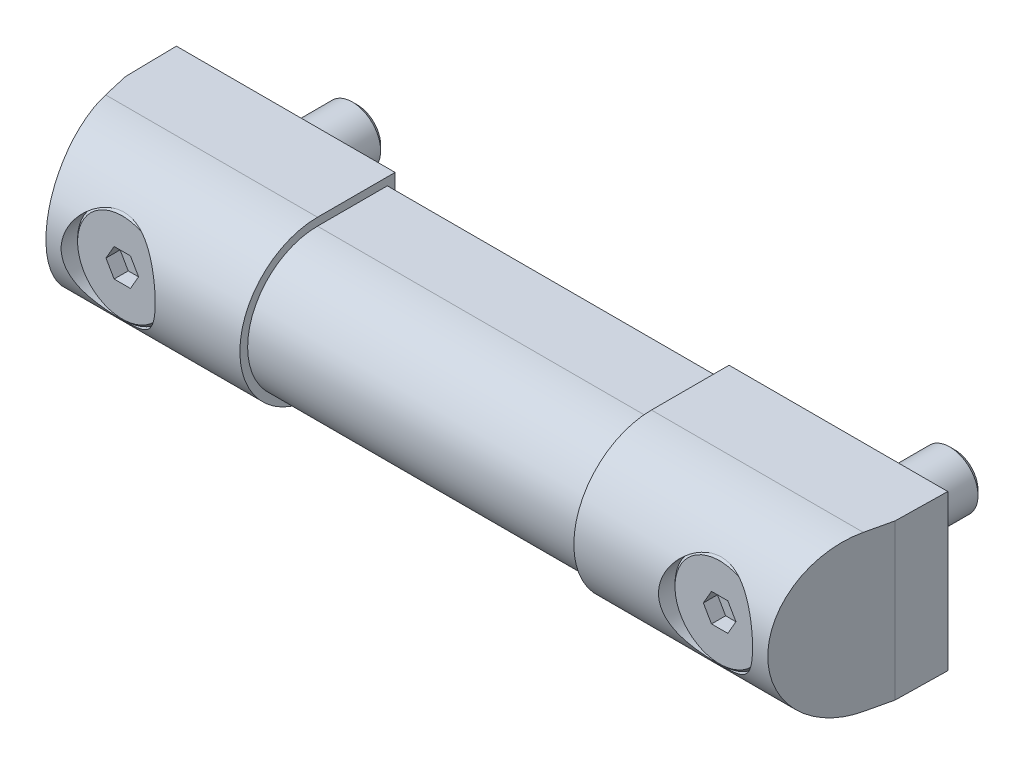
ISO-10303-21;
HEADER;
FILE_DESCRIPTION(('STEP AP214'),'2;1');
FILE_NAME('part.step','',(''),(''),'','','');
FILE_SCHEMA(('AUTOMOTIVE_DESIGN { 1 0 10303 214 1 1 1 1 }'));
ENDSEC;
DATA;
#1=APPLICATION_CONTEXT('core data for automotive mechanical design processes');
#2=APPLICATION_PROTOCOL_DEFINITION('international standard','automotive_design',2000,#1);
#3=PRODUCT_CONTEXT('',#1,'mechanical');
#4=PRODUCT('Part','Part','',(#3));
#5=PRODUCT_RELATED_PRODUCT_CATEGORY('part','',(#4));
#6=PRODUCT_DEFINITION_FORMATION('','',#4);
#7=PRODUCT_DEFINITION_CONTEXT('part definition',#1,'design');
#8=PRODUCT_DEFINITION('design','',#6,#7);
#9=PRODUCT_DEFINITION_SHAPE('','',#8);
#10=(LENGTH_UNIT() NAMED_UNIT(*) SI_UNIT(.MILLI.,.METRE.));
#11=(NAMED_UNIT(*) PLANE_ANGLE_UNIT() SI_UNIT($,.RADIAN.));
#12=(NAMED_UNIT(*) SI_UNIT($,.STERADIAN.) SOLID_ANGLE_UNIT());
#13=UNCERTAINTY_MEASURE_WITH_UNIT(LENGTH_MEASURE(1.E-05),#10,'distance_accuracy_value','');
#14=(GEOMETRIC_REPRESENTATION_CONTEXT(3) GLOBAL_UNCERTAINTY_ASSIGNED_CONTEXT((#13)) GLOBAL_UNIT_ASSIGNED_CONTEXT((#10,
#11,#12)) REPRESENTATION_CONTEXT('',''));
#15=CARTESIAN_POINT('',(0.,0.,0.));
#16=DIRECTION('',(0.,0.,1.));
#17=DIRECTION('',(1.,0.,0.));
#18=AXIS2_PLACEMENT_3D('',#15,#16,#17);
#19=CARTESIAN_POINT('',(-18.5,-2.8456674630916E-13,16.5));
#20=DIRECTION('',(1.,0.,0.));
#21=DIRECTION('',(0.,0.,-1.));
#22=AXIS2_PLACEMENT_3D('',#19,#20,#21);
#23=CYLINDRICAL_SURFACE('',#22,16.5);
#24=CARTESIAN_POINT('',(144.038219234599,2.82932412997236E-13,16.5));
#25=DIRECTION('',(0.974370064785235,0.,0.224951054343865));
#26=DIRECTION('',(0.224951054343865,0.,-0.974370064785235));
#27=AXIS2_PLACEMENT_3D('',#24,#25,#26);
#28=ELLIPSE('',#27,16.934017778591,16.5);
#29=CARTESIAN_POINT('',(144.038219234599,16.5000000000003,16.5));
#30=VERTEX_POINT('',#29);
#31=CARTESIAN_POINT('',(144.038219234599,-16.4999999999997,16.5));
#32=VERTEX_POINT('',#31);
#33=EDGE_CURVE('E347',#30,#32,#28,.T.);
#34=ORIENTED_EDGE('',*,*,#33,.F.);
#35=DIRECTION('',(1.,0.,0.));
#36=VECTOR('',#35,1.);
#37=CARTESIAN_POINT('',(-18.5,16.4999999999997,16.5));
#38=LINE('',#37,#36);
#39=CARTESIAN_POINT('',(99.,16.5,16.5));
#40=VERTEX_POINT('',#39);
#41=EDGE_CURVE('E421',#40,#30,#38,.T.);
#42=ORIENTED_EDGE('',*,*,#41,.F.);
#43=CARTESIAN_POINT('',(99.,1.25682311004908E-13,16.5));
#44=DIRECTION('',(-1.,0.,0.));
#45=DIRECTION('',(0.,0.,1.));
#46=AXIS2_PLACEMENT_3D('',#43,#44,#45);
#47=CIRCLE('',#46,16.5);
#48=CARTESIAN_POINT('',(99.,-16.5,16.5));
#49=VERTEX_POINT('',#48);
#50=EDGE_CURVE('E395',#49,#40,#47,.T.);
#51=ORIENTED_EDGE('',*,*,#50,.F.);
#52=DIRECTION('',(1.,0.,0.));
#53=VECTOR('',#52,1.);
#54=CARTESIAN_POINT('',(-18.5,-16.5000000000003,16.5));
#55=LINE('',#54,#53);
#56=EDGE_CURVE('E424',#49,#32,#55,.T.);
#57=ORIENTED_EDGE('',*,*,#56,.T.);
#58=EDGE_LOOP('',(#34,#42,#51,#57));
#59=FACE_BOUND('',#58,.T.);
#60=CARTESIAN_POINT('',(127.,-9.99999999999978,29.6244047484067));
#61=CARTESIAN_POINT('',(127.250548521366,-9.99999727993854,29.6244089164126));
#62=CARTESIAN_POINT('',(127.501185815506,-9.99056426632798,29.6316108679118));
#63=CARTESIAN_POINT('',(128.000362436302,-9.95298990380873,29.6601111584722));
#64=CARTESIAN_POINT('',(128.248900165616,-9.92483541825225,29.6814193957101));
#65=CARTESIAN_POINT('',(128.742293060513,-9.85021865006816,29.7372716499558));
#66=CARTESIAN_POINT('',(128.987138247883,-9.80371368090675,29.771846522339));
#67=CARTESIAN_POINT('',(129.470913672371,-9.69310075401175,29.852845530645));
#68=CARTESIAN_POINT('',(129.709840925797,-9.6289841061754,29.8992755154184));
#69=CARTESIAN_POINT('',(130.178225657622,-9.4846413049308,30.0018271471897));
#70=CARTESIAN_POINT('',(130.407747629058,-9.40456077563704,30.0578605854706));
#71=CARTESIAN_POINT('',(130.858576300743,-9.22875714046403,30.1781351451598));
#72=CARTESIAN_POINT('',(131.079879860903,-9.13302812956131,30.2423793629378));
#73=CARTESIAN_POINT('',(131.513324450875,-8.92678470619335,30.3772361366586));
#74=CARTESIAN_POINT('',(131.725469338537,-8.81627660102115,30.4478459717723));
#75=CARTESIAN_POINT('',(132.140103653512,-8.58115049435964,30.593721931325));
#76=CARTESIAN_POINT('',(132.342592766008,-8.45653203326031,30.6689882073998));
#77=CARTESIAN_POINT('',(132.762185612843,-8.17731243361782,30.832162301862));
#78=CARTESIAN_POINT('',(132.977936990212,-8.02091114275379,30.9204716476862));
#79=CARTESIAN_POINT('',(133.395836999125,-7.69181354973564,31.0986648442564));
#80=CARTESIAN_POINT('',(133.597988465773,-7.51912066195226,31.1885483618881));
#81=CARTESIAN_POINT('',(133.988195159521,-7.15792313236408,31.3679126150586));
#82=CARTESIAN_POINT('',(134.176238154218,-6.96940506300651,31.457392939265));
#83=CARTESIAN_POINT('',(134.537243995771,-6.57730830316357,31.6339107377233));
#84=CARTESIAN_POINT('',(134.710204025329,-6.37372681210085,31.7209477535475));
#85=CARTESIAN_POINT('',(135.058456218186,-5.9287217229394,31.9001298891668));
#86=CARTESIAN_POINT('',(135.231861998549,-5.68560890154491,31.9917640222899));
#87=CARTESIAN_POINT('',(135.557279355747,-5.18291135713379,32.1671073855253));
#88=CARTESIAN_POINT('',(135.709300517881,-4.92333409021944,32.2508201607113));
#89=CARTESIAN_POINT('',(135.990342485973,-4.38916490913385,32.4079442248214));
#90=CARTESIAN_POINT('',(136.119373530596,-4.11457975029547,32.4813600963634));
#91=CARTESIAN_POINT('',(136.352785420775,-3.55218904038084,32.6156904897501));
#92=CARTESIAN_POINT('',(136.457170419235,-3.26438572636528,32.676607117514));
#93=CARTESIAN_POINT('',(136.630808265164,-2.7063724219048,32.7787603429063));
#94=CARTESIAN_POINT('',(136.702485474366,-2.43716048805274,32.8213320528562));
#95=CARTESIAN_POINT('',(136.823350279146,-1.89201242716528,32.8934698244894));
#96=CARTESIAN_POINT('',(136.872539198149,-1.61607669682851,32.9230366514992));
#97=CARTESIAN_POINT('',(136.947597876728,-1.06014571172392,32.968266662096));
#98=CARTESIAN_POINT('',(136.973486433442,-0.780153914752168,32.9839410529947));
#99=CARTESIAN_POINT('',(137.001562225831,-0.218560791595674,33.0009428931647));
#100=CARTESIAN_POINT('',(137.003751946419,0.0630403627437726,33.00227184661));
#101=CARTESIAN_POINT('',(136.985632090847,0.589481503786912,32.9912952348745));
#102=CARTESIAN_POINT('',(136.968136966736,0.8344602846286,32.9806951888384));
#103=CARTESIAN_POINT('',(136.915288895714,1.32178088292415,32.9487843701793));
#104=CARTESIAN_POINT('',(136.879936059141,1.56412271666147,32.9274736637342));
#105=CARTESIAN_POINT('',(136.791821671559,2.04447088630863,32.8746307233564));
#106=CARTESIAN_POINT('',(136.73906032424,2.2824772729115,32.8430986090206));
#107=CARTESIAN_POINT('',(136.616752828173,2.75264906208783,32.7705105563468));
#108=CARTESIAN_POINT('',(136.547205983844,2.98481422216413,32.7294542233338));
#109=CARTESIAN_POINT('',(136.391706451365,3.44306234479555,32.6384682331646));
#110=CARTESIAN_POINT('',(136.305676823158,3.66911087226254,32.5884970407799));
#111=CARTESIAN_POINT('',(136.118228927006,4.11290023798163,32.4808076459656));
#112=CARTESIAN_POINT('',(136.016805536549,4.33063828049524,32.423086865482));
#113=CARTESIAN_POINT('',(135.799460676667,4.75675178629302,32.3010260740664));
#114=CARTESIAN_POINT('',(135.683541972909,4.9651290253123,32.2366873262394));
#115=CARTESIAN_POINT('',(135.43797715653,5.37187163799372,32.1025280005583));
#116=CARTESIAN_POINT('',(135.308326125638,5.5702333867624,32.0327054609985));
#117=CARTESIAN_POINT('',(135.019710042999,5.97948706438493,31.8801489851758));
#118=CARTESIAN_POINT('',(134.859094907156,6.18901433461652,31.7968724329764));
#119=CARTESIAN_POINT('',(134.522553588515,6.59397786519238,31.6267222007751));
#120=CARTESIAN_POINT('',(134.34662041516,6.78940761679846,31.5398468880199));
#121=CARTESIAN_POINT('',(133.98015455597,7.16564591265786,31.3642745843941));
#122=CARTESIAN_POINT('',(133.789605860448,7.34643796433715,31.2755756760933));
#123=CARTESIAN_POINT('',(133.394832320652,7.69253107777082,31.0983823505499));
#124=CARTESIAN_POINT('',(133.19060698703,7.85783158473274,31.0098879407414));
#125=CARTESIAN_POINT('',(132.743930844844,8.19108722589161,30.8246861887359));
#126=CARTESIAN_POINT('',(132.499829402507,8.35699585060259,30.7282622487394));
#127=CARTESIAN_POINT('',(131.996209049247,8.66749171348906,30.5412765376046));
#128=CARTESIAN_POINT('',(131.736687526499,8.81207532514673,30.4507157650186));
#129=CARTESIAN_POINT('',(131.20372926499,9.07839554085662,30.278890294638));
#130=CARTESIAN_POINT('',(130.9303142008,9.20016642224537,30.197611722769));
#131=CARTESIAN_POINT('',(130.370680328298,9.41959402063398,30.047654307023));
#132=CARTESIAN_POINT('',(130.084466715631,9.51726041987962,29.978970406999));
#133=CARTESIAN_POINT('',(129.574638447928,9.66555338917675,29.872851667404));
#134=CARTESIAN_POINT('',(129.353385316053,9.72183281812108,29.8319021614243));
#135=CARTESIAN_POINT('',(128.905976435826,9.81935029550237,29.7602425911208));
#136=CARTESIAN_POINT('',(128.679821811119,9.86059175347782,29.7295302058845));
#137=CARTESIAN_POINT('',(128.224196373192,9.92745207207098,29.6794326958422));
#138=CARTESIAN_POINT('',(127.9947291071,9.95308653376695,29.6600362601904));
#139=CARTESIAN_POINT('',(127.533858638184,9.98841339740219,29.6332438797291));
#140=CARTESIAN_POINT('',(127.302455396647,9.9981054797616,29.6258481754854));
#141=CARTESIAN_POINT('',(126.839101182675,10.0013935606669,29.6233430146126));
#142=CARTESIAN_POINT('',(126.607149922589,9.99496409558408,29.6282529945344));
#143=CARTESIAN_POINT('',(126.144834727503,9.96605936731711,29.650208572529));
#144=CARTESIAN_POINT('',(125.914470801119,9.94358401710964,29.6672542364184));
#145=CARTESIAN_POINT('',(125.456829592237,9.88291185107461,29.712853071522));
#146=CARTESIAN_POINT('',(125.229554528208,9.84470429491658,29.7414141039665));
#147=CARTESIAN_POINT('',(124.779692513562,9.75309891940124,29.8090305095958));
#148=CARTESIAN_POINT('',(124.557105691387,9.69970068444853,29.8480861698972));
#149=CARTESIAN_POINT('',(124.118900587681,9.57865744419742,29.9352091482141));
#150=CARTESIAN_POINT('',(123.903253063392,9.51108489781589,29.9832305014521));
#151=CARTESIAN_POINT('',(123.478641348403,9.36219458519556,30.0870358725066));
#152=CARTESIAN_POINT('',(123.269679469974,9.28087212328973,30.1428225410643));
#153=CARTESIAN_POINT('',(122.654025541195,9.01730269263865,30.3196607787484));
#154=CARTESIAN_POINT('',(122.258350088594,8.81539340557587,30.4502358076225));
#155=CARTESIAN_POINT('',(121.431354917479,8.32241190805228,30.750790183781));
#156=CARTESIAN_POINT('',(121.006757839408,8.02178535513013,30.9236080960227));
#157=CARTESIAN_POINT('',(120.40922826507,7.52522015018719,31.1852414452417));
#158=CARTESIAN_POINT('',(120.21647621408,7.35193937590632,31.2729237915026));
#159=CARTESIAN_POINT('',(119.844691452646,6.9906180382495,31.4472889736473));
#160=CARTESIAN_POINT('',(119.665661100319,6.80257494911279,31.5339716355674));
#161=CARTESIAN_POINT('',(119.298565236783,6.38555565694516,31.7162195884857));
#162=CARTESIAN_POINT('',(119.112641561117,6.15450617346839,31.8113676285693));
#163=CARTESIAN_POINT('',(118.761080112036,5.67525068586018,31.9953987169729));
#164=CARTESIAN_POINT('',(118.595434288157,5.42705155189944,32.084284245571));
#165=CARTESIAN_POINT('',(118.285899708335,4.91467336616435,32.2533724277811));
#166=CARTESIAN_POINT('',(118.142006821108,4.65049736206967,32.3335767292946));
#167=CARTESIAN_POINT('',(117.877620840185,4.10771082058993,32.4829879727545));
#168=CARTESIAN_POINT('',(117.757124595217,3.82910223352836,32.5521963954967));
#169=CARTESIAN_POINT('',(117.548769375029,3.27940348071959,32.6730974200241));
#170=CARTESIAN_POINT('',(117.459216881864,3.00915089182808,32.7256766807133));
#171=CARTESIAN_POINT('',(117.303080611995,2.45992602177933,32.8179739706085));
#172=CARTESIAN_POINT('',(117.236496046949,2.18095404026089,32.8576924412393));
#173=CARTESIAN_POINT('',(117.12742474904,1.61699192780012,32.9230276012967));
#174=CARTESIAN_POINT('',(117.084914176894,1.33200804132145,32.9486582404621));
#175=CARTESIAN_POINT('',(117.024642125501,0.758506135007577,32.9850592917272));
#176=CARTESIAN_POINT('',(117.006877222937,0.46998860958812,32.9958317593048));
#177=CARTESIAN_POINT('',(116.997123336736,-0.068041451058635,33.0017437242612));
#178=CARTESIAN_POINT('',(117.001936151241,-0.317481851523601,32.99882295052));
#179=CARTESIAN_POINT('',(117.030146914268,-0.814902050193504,32.9817426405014));
#180=CARTESIAN_POINT('',(117.053542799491,-1.06288200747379,32.9675843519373));
#181=CARTESIAN_POINT('',(117.11860211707,-1.55554553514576,32.9283703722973));
#182=CARTESIAN_POINT('',(117.160265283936,-1.80022915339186,32.9033148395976));
#183=CARTESIAN_POINT('',(117.261325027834,-2.28460549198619,32.8428929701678));
#184=CARTESIAN_POINT('',(117.320722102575,-2.52429807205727,32.8075263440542));
#185=CARTESIAN_POINT('',(117.455146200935,-2.99229378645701,32.728103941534));
#186=CARTESIAN_POINT('',(117.529826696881,-3.22072977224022,32.6842418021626));
#187=CARTESIAN_POINT('',(117.694785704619,-3.67019328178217,32.588272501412));
#188=CARTESIAN_POINT('',(117.785069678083,-3.89121817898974,32.5361624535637));
#189=CARTESIAN_POINT('',(117.980378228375,-4.32468773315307,32.4247338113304));
#190=CARTESIAN_POINT('',(118.085399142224,-4.53713450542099,32.3654170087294));
#191=CARTESIAN_POINT('',(118.309417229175,-4.95272900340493,32.2406344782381));
#192=CARTESIAN_POINT('',(118.428419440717,-5.15587333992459,32.1751665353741));
#193=CARTESIAN_POINT('',(118.693072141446,-5.57336647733,32.0319467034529));
#194=CARTESIAN_POINT('',(118.840211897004,-5.78657827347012,31.9536305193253));
#195=CARTESIAN_POINT('',(119.149709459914,-6.19997176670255,31.7924687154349));
#196=CARTESIAN_POINT('',(119.312074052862,-6.40014758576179,31.7096210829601));
#197=CARTESIAN_POINT('',(119.651239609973,-6.78689393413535,31.5410307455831));
#198=CARTESIAN_POINT('',(119.828052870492,-6.97345261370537,31.455285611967));
#199=CARTESIAN_POINT('',(120.195228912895,-7.33218780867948,31.2827145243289));
#200=CARTESIAN_POINT('',(120.385592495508,-7.50436347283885,31.1958885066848));
#201=CARTESIAN_POINT('',(120.805095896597,-7.85541111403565,31.0116091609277));
#202=CARTESIAN_POINT('',(121.036042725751,-8.03218549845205,30.9142600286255));
#203=CARTESIAN_POINT('',(121.513563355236,-8.36563384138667,30.7233292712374));
#204=CARTESIAN_POINT('',(121.760139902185,-8.52230425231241,30.6297483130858));
#205=CARTESIAN_POINT('',(122.267837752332,-8.81432663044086,30.4494473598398));
#206=CARTESIAN_POINT('',(122.52895149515,-8.94968954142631,30.3627238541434));
#207=CARTESIAN_POINT('',(123.064668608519,-9.19783858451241,30.1993374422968));
#208=CARTESIAN_POINT('',(123.339267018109,-9.31063294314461,30.1226708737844));
#209=CARTESIAN_POINT('',(123.837762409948,-9.48967272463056,29.998340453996));
#210=CARTESIAN_POINT('',(124.059293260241,-9.56068851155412,29.9480227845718));
#211=CARTESIAN_POINT('',(124.508582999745,-9.6874810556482,29.856976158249));
#212=CARTESIAN_POINT('',(124.736340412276,-9.74326139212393,29.8162449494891));
#213=CARTESIAN_POINT('',(125.19620643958,-9.83876672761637,29.7458365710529));
#214=CARTESIAN_POINT('',(125.428301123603,-9.87853613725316,29.7161288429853));
#215=CARTESIAN_POINT('',(125.895838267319,-9.9416497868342,29.6687196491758));
#216=CARTESIAN_POINT('',(126.13127861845,-9.96500394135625,29.6510109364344));
#217=CARTESIAN_POINT('',(126.472686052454,-9.98664449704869,29.6345721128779));
#218=CARTESIAN_POINT('',(126.578036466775,-9.99165014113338,29.6307633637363));
#219=CARTESIAN_POINT('',(126.788919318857,-9.99832872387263,29.6256786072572));
#220=CARTESIAN_POINT('',(126.894451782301,-10.0000011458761,29.6244029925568));
#221=CARTESIAN_POINT('',(127.,-9.99999999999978,29.6244047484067));
#222=B_SPLINE_CURVE_WITH_KNOTS('',3,(#60,#61,#62,#63,#64,#65,#66,#67,#68,#69,#70,#71,#72,#73,
#74,#75,#76,#77,#78,#79,#80,#81,#82,#83,#84,#85,#86,#87,#88,#89,#90,#91,#92,#93,#94,#95,#96,#97,
#98,#99,#100,#101,#102,#103,#104,#105,#106,#107,#108,#109,#110,#111,#112,#113,#114,#115,#116,
#117,#118,#119,#120,#121,#122,#123,#124,#125,#126,#127,#128,#129,#130,#131,#132,#133,#134,#135,
#136,#137,#138,#139,#140,#141,#142,#143,#144,#145,#146,#147,#148,#149,#150,#151,#152,#153,#154,
#155,#156,#157,#158,#159,#160,#161,#162,#163,#164,#165,#166,#167,#168,#169,#170,#171,#172,#173,
#174,#175,#176,#177,#178,#179,#180,#181,#182,#183,#184,#185,#186,#187,#188,#189,#190,#191,#192,
#193,#194,#195,#196,#197,#198,#199,#200,#201,#202,#203,#204,#205,#206,#207,#208,#209,#210,#211,
#212,#213,#214,#215,#216,#217,#218,#219,#220,#221),.UNSPECIFIED.,.T.,.F.,(4,2,2,2,2,2,2,2,2,2,2,
2,2,2,2,2,2,2,2,2,2,2,2,2,2,2,2,2,2,2,2,2,2,2,2,2,2,2,2,2,2,2,2,2,2,2,2,2,2,2,2,2,2,2,2,2,2,2,2,
2,2,2,2,2,2,2,2,2,2,2,2,2,2,2,2,2,2,2,2,2,4),(0.,0.751522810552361,1.50357351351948,
2.25738403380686,3.01156717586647,3.75916185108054,4.50703928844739,5.25459856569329,
6.00218219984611,6.84353052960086,7.68470292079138,8.52659639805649,9.36864679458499,
10.3044959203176,11.2399242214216,12.1749348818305,13.1097878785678,13.954041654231,
14.7982457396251,15.6417681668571,16.485202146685,17.2218136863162,17.9584206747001,
18.6950190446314,19.431647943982,20.1718030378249,20.9122049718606,21.6524658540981,
22.3929927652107,23.2226330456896,24.0526539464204,24.8835973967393,25.7145705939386,
26.6449173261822,27.5754220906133,28.5045173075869,29.4332387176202,30.1283695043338,
30.8233425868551,31.5176198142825,32.2119109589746,32.9072994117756,33.6026916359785,
34.2985593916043,34.994446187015,35.6868587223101,36.3795081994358,37.7641298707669,
39.4020709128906,40.2223371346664,41.0427440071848,41.9759441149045,42.9087725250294,
43.8414235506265,44.7739488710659,45.6412364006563,46.5084941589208,47.3748916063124,
48.2411691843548,48.9887530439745,49.7362539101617,50.4837439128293,51.2312548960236,
51.9633942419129,52.6957903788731,53.4280047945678,54.1604838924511,54.9715666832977,
55.7830127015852,56.5951566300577,57.407348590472,58.3263617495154,59.2455368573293,
60.1642383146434,61.0826042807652,61.7959567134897,62.5091414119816,63.2203340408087,
63.9310967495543,64.2476406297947,64.5642335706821),.UNSPECIFIED.);
#223=CARTESIAN_POINT('',(127.,-9.99999999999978,29.6244047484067));
#224=VERTEX_POINT('',#223);
#225=EDGE_CURVE('E9',#224,#224,#222,.T.);
#226=ORIENTED_EDGE('',*,*,#225,.F.);
#227=EDGE_LOOP('',(#226));
#228=FACE_BOUND('',#227,.T.);
#229=ADVANCED_FACE('F14',(#59,#228),#23,.T.);
#230=CARTESIAN_POINT('',(-17.038219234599,-2.79462966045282E-13,16.5));
#231=DIRECTION('',(-0.974370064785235,0.,0.224951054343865));
#232=DIRECTION('',(0.224951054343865,0.,0.974370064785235));
#233=AXIS2_PLACEMENT_3D('',#230,#231,#232);
#234=ELLIPSE('',#233,16.934017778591,16.5);
#235=CARTESIAN_POINT('',(-17.0382192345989,-16.5000000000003,16.5));
#236=VERTEX_POINT('',#235);
#237=CARTESIAN_POINT('',(-17.038219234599,16.4999999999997,16.5));
#238=VERTEX_POINT('',#237);
#239=EDGE_CURVE('E357',#236,#238,#234,.T.);
#240=ORIENTED_EDGE('',*,*,#239,.F.);
#241=CARTESIAN_POINT('',(28.,-16.5,16.5));
#242=VERTEX_POINT('',#241);
#243=EDGE_CURVE('E425',#236,#242,#55,.T.);
#244=ORIENTED_EDGE('',*,*,#243,.T.);
#245=CARTESIAN_POINT('',(28.,-1.22212864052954E-13,16.5));
#246=DIRECTION('',(-1.,0.,0.));
#247=DIRECTION('',(0.,0.,1.));
#248=AXIS2_PLACEMENT_3D('',#245,#246,#247);
#249=CIRCLE('',#248,16.5);
#250=CARTESIAN_POINT('',(28.,16.5,16.5));
#251=VERTEX_POINT('',#250);
#252=EDGE_CURVE('E402',#242,#251,#249,.T.);
#253=ORIENTED_EDGE('',*,*,#252,.T.);
#254=EDGE_CURVE('E422',#238,#251,#38,.T.);
#255=ORIENTED_EDGE('',*,*,#254,.F.);
#256=EDGE_LOOP('',(#240,#244,#253,#255));
#257=FACE_BOUND('',#256,.T.);
#258=CARTESIAN_POINT('',(0.,-10.0000000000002,29.6244047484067));
#259=CARTESIAN_POINT('',(0.250548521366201,-9.99999727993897,29.6244089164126));
#260=CARTESIAN_POINT('',(0.501185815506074,-9.99056426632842,29.6316108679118));
#261=CARTESIAN_POINT('',(1.00036243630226,-9.95298990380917,29.6601111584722));
#262=CARTESIAN_POINT('',(1.24890016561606,-9.92483541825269,29.6814193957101));
#263=CARTESIAN_POINT('',(1.74229306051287,-9.8502186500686,29.7372716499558));
#264=CARTESIAN_POINT('',(1.98713824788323,-9.80371368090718,29.771846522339));
#265=CARTESIAN_POINT('',(2.47091367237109,-9.69310075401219,29.852845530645));
#266=CARTESIAN_POINT('',(2.70984092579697,-9.62898410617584,29.8992755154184));
#267=CARTESIAN_POINT('',(3.1782256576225,-9.48464130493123,30.0018271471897));
#268=CARTESIAN_POINT('',(3.40774762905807,-9.40456077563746,30.0578605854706));
#269=CARTESIAN_POINT('',(3.85857630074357,-9.22875714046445,30.1781351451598));
#270=CARTESIAN_POINT('',(4.07987986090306,-9.13302812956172,30.2423793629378));
#271=CARTESIAN_POINT('',(4.51332445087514,-8.92678470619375,30.3772361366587));
#272=CARTESIAN_POINT('',(4.7254693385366,-8.81627660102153,30.4478459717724));
#273=CARTESIAN_POINT('',(5.14010365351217,-8.58115049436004,30.593721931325));
#274=CARTESIAN_POINT('',(5.34259276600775,-8.45653203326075,30.6689882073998));
#275=CARTESIAN_POINT('',(5.76218561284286,-8.17731243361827,30.832162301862));
#276=CARTESIAN_POINT('',(5.97793699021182,-8.0209111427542,30.9204716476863));
#277=CARTESIAN_POINT('',(6.39583699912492,-7.69181354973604,31.0986648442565));
#278=CARTESIAN_POINT('',(6.59798846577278,-7.51912066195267,31.1885483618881));
#279=CARTESIAN_POINT('',(6.98819515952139,-7.15792313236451,31.3679126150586));
#280=CARTESIAN_POINT('',(7.17623815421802,-6.96940506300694,31.457392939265));
#281=CARTESIAN_POINT('',(7.53724399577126,-6.577308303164,31.6339107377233));
#282=CARTESIAN_POINT('',(7.71020402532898,-6.37372681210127,31.7209477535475));
#283=CARTESIAN_POINT('',(8.05845621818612,-5.92872172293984,31.9001298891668));
#284=CARTESIAN_POINT('',(8.23186199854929,-5.68560890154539,31.9917640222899));
#285=CARTESIAN_POINT('',(8.5572793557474,-5.18291135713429,32.1671073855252));
#286=CARTESIAN_POINT('',(8.70930051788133,-4.92333409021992,32.2508201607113));
#287=CARTESIAN_POINT('',(8.99034248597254,-4.38916490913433,32.4079442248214));
#288=CARTESIAN_POINT('',(9.11937353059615,-4.11457975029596,32.4813600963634));
#289=CARTESIAN_POINT('',(9.3527854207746,-3.55218904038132,32.6156904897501));
#290=CARTESIAN_POINT('',(9.45717041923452,-3.26438572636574,32.676607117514));
#291=CARTESIAN_POINT('',(9.63080826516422,-2.70637242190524,32.7787603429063));
#292=CARTESIAN_POINT('',(9.70248547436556,-2.43716048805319,32.8213320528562));
#293=CARTESIAN_POINT('',(9.82335027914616,-1.89201242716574,32.8934698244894));
#294=CARTESIAN_POINT('',(9.87253919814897,-1.61607669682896,32.9230366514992));
#295=CARTESIAN_POINT('',(9.94759787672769,-1.06014571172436,32.968266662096));
#296=CARTESIAN_POINT('',(9.97348643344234,-0.780153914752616,32.9839410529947));
#297=CARTESIAN_POINT('',(10.0015622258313,-0.218560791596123,33.0009428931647));
#298=CARTESIAN_POINT('',(10.003751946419,0.0630403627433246,33.00227184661));
#299=CARTESIAN_POINT('',(9.98563209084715,0.589481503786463,32.9912952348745));
#300=CARTESIAN_POINT('',(9.96813696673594,0.834460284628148,32.9806951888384));
#301=CARTESIAN_POINT('',(9.91528889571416,1.32178088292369,32.9487843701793));
#302=CARTESIAN_POINT('',(9.87993605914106,1.56412271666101,32.9274736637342));
#303=CARTESIAN_POINT('',(9.79182167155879,2.04447088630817,32.8746307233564));
#304=CARTESIAN_POINT('',(9.73906032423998,2.28247727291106,32.8430986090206));
#305=CARTESIAN_POINT('',(9.6167528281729,2.75264906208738,32.7705105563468));
#306=CARTESIAN_POINT('',(9.5472059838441,2.98481422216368,32.7294542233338));
#307=CARTESIAN_POINT('',(9.39170645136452,3.44306234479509,32.6384682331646));
#308=CARTESIAN_POINT('',(9.30567682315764,3.66911087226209,32.5884970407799));
#309=CARTESIAN_POINT('',(9.11822892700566,4.11290023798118,32.4808076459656));
#310=CARTESIAN_POINT('',(9.01680553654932,4.33063828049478,32.423086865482));
#311=CARTESIAN_POINT('',(8.79946067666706,4.75675178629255,32.3010260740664));
#312=CARTESIAN_POINT('',(8.68354197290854,4.96512902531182,32.2366873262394));
#313=CARTESIAN_POINT('',(8.43797715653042,5.37187163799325,32.1025280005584));
#314=CARTESIAN_POINT('',(8.30832612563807,5.57023338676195,32.0327054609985));
#315=CARTESIAN_POINT('',(8.01971004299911,5.97948706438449,31.8801489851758));
#316=CARTESIAN_POINT('',(7.85909490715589,6.18901433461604,31.7968724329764));
#317=CARTESIAN_POINT('',(7.52255358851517,6.59397786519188,31.6267222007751));
#318=CARTESIAN_POINT('',(7.34662041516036,6.78940761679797,31.5398468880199));
#319=CARTESIAN_POINT('',(6.98015455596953,7.16564591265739,31.3642745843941));
#320=CARTESIAN_POINT('',(6.78960586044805,7.34643796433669,31.2755756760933));
#321=CARTESIAN_POINT('',(6.39483232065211,7.69253107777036,31.0983823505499));
#322=CARTESIAN_POINT('',(6.19060698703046,7.85783158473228,31.0098879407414));
#323=CARTESIAN_POINT('',(5.74393084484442,8.19108722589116,30.8246861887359));
#324=CARTESIAN_POINT('',(5.49982940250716,8.35699585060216,30.7282622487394));
#325=CARTESIAN_POINT('',(4.99620904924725,8.66749171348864,30.5412765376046));
#326=CARTESIAN_POINT('',(4.73668752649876,8.8120753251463,30.4507157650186));
#327=CARTESIAN_POINT('',(4.20372926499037,9.07839554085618,30.2788902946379));
#328=CARTESIAN_POINT('',(3.93031420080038,9.20016642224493,30.197611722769));
#329=CARTESIAN_POINT('',(3.37068032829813,9.41959402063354,30.047654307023));
#330=CARTESIAN_POINT('',(3.08446671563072,9.51726041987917,29.978970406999));
#331=CARTESIAN_POINT('',(2.5746384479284,9.6655533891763,29.872851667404));
#332=CARTESIAN_POINT('',(2.35338531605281,9.72183281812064,29.8319021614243));
#333=CARTESIAN_POINT('',(1.90597643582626,9.81935029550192,29.7602425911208));
#334=CARTESIAN_POINT('',(1.67982181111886,9.86059175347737,29.7295302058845));
#335=CARTESIAN_POINT('',(1.2241963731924,9.92745207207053,29.6794326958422));
#336=CARTESIAN_POINT('',(0.994729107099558,9.9530865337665,29.6600362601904));
#337=CARTESIAN_POINT('',(0.533858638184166,9.98841339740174,29.6332438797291));
#338=CARTESIAN_POINT('',(0.302455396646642,9.99810547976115,29.6258481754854));
#339=CARTESIAN_POINT('',(-0.16089881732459,10.0013935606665,29.6233430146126));
#340=CARTESIAN_POINT('',(-0.392850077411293,9.99496409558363,29.6282529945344));
#341=CARTESIAN_POINT('',(-0.855165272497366,9.96605936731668,29.650208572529));
#342=CARTESIAN_POINT('',(-1.08552919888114,9.9435840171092,29.6672542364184));
#343=CARTESIAN_POINT('',(-1.54317040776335,9.88291185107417,29.712853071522));
#344=CARTESIAN_POINT('',(-1.77044547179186,9.84470429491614,29.7414141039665));
#345=CARTESIAN_POINT('',(-2.22030748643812,9.75309891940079,29.8090305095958));
#346=CARTESIAN_POINT('',(-2.44289430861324,9.69970068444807,29.8480861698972));
#347=CARTESIAN_POINT('',(-2.88109941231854,9.57865744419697,29.9352091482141));
#348=CARTESIAN_POINT('',(-3.0967469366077,9.51108489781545,29.9832305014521));
#349=CARTESIAN_POINT('',(-3.52135865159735,9.36219458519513,30.0870358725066));
#350=CARTESIAN_POINT('',(-3.73032053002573,9.2808721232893,30.1428225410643));
#351=CARTESIAN_POINT('',(-4.34597445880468,9.0173026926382,30.3196607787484));
#352=CARTESIAN_POINT('',(-4.74164991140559,8.81539340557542,30.4502358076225));
#353=CARTESIAN_POINT('',(-5.56864508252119,8.32241190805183,30.750790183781));
#354=CARTESIAN_POINT('',(-5.99324216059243,8.02178535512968,30.9236080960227));
#355=CARTESIAN_POINT('',(-6.59077173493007,7.52522015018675,31.1852414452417));
#356=CARTESIAN_POINT('',(-6.78352378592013,7.3519393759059,31.2729237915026));
#357=CARTESIAN_POINT('',(-7.15530854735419,6.99061803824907,31.4472889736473));
#358=CARTESIAN_POINT('',(-7.33433889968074,6.80257494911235,31.5339716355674));
#359=CARTESIAN_POINT('',(-7.70143476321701,6.38555565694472,31.7162195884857));
#360=CARTESIAN_POINT('',(-7.88735843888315,6.15450617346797,31.8113676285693));
#361=CARTESIAN_POINT('',(-8.23891988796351,5.67525068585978,31.9953987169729));
#362=CARTESIAN_POINT('',(-8.40456571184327,5.42705155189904,32.084284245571));
#363=CARTESIAN_POINT('',(-8.71410029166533,4.91467336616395,32.253372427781));
#364=CARTESIAN_POINT('',(-8.85799317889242,4.65049736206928,32.3335767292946));
#365=CARTESIAN_POINT('',(-9.12237915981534,4.10771082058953,32.4829879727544));
#366=CARTESIAN_POINT('',(-9.24287540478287,3.82910223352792,32.5521963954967));
#367=CARTESIAN_POINT('',(-9.4512306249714,3.27940348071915,32.6730974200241));
#368=CARTESIAN_POINT('',(-9.54078311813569,3.00915089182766,32.7256766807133));
#369=CARTESIAN_POINT('',(-9.69691938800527,2.45992602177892,32.8179739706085));
#370=CARTESIAN_POINT('',(-9.76350395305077,2.18095404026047,32.8576924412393));
#371=CARTESIAN_POINT('',(-9.87257525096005,1.6169919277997,32.9230276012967));
#372=CARTESIAN_POINT('',(-9.91508582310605,1.33200804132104,32.9486582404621));
#373=CARTESIAN_POINT('',(-9.97535787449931,0.758506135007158,32.9850592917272));
#374=CARTESIAN_POINT('',(-9.99312277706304,0.469988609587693,32.9958317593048));
#375=CARTESIAN_POINT('',(-10.0028766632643,-0.0680414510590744,33.0017437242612));
#376=CARTESIAN_POINT('',(-9.99806384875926,-0.317481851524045,32.99882295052));
#377=CARTESIAN_POINT('',(-9.9698530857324,-0.81490205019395,32.9817426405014));
#378=CARTESIAN_POINT('',(-9.94645720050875,-1.06288200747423,32.9675843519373));
#379=CARTESIAN_POINT('',(-9.88139788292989,-1.55554553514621,32.9283703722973));
#380=CARTESIAN_POINT('',(-9.83973471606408,-1.80022915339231,32.9033148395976));
#381=CARTESIAN_POINT('',(-9.73867497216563,-2.28460549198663,32.8428929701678));
#382=CARTESIAN_POINT('',(-9.679277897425,-2.5242980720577,32.8075263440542));
#383=CARTESIAN_POINT('',(-9.54485379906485,-2.99229378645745,32.728103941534));
#384=CARTESIAN_POINT('',(-9.47017330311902,-3.22072977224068,32.6842418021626));
#385=CARTESIAN_POINT('',(-9.30521429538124,-3.67019328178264,32.5882725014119));
#386=CARTESIAN_POINT('',(-9.21493032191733,-3.8912181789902,32.5361624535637));
#387=CARTESIAN_POINT('',(-9.01962177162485,-4.32468773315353,32.4247338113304));
#388=CARTESIAN_POINT('',(-8.91460085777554,-4.53713450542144,32.3654170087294));
#389=CARTESIAN_POINT('',(-8.69058277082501,-4.95272900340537,32.2406344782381));
#390=CARTESIAN_POINT('',(-8.57158055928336,-5.15587333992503,32.1751665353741));
#391=CARTESIAN_POINT('',(-8.30692785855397,-5.57336647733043,32.0319467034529));
#392=CARTESIAN_POINT('',(-8.15978810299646,-5.78657827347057,31.9536305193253));
#393=CARTESIAN_POINT('',(-7.85029054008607,-6.199971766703,31.7924687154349));
#394=CARTESIAN_POINT('',(-7.68792594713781,-6.40014758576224,31.7096210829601));
#395=CARTESIAN_POINT('',(-7.34876039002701,-6.78689393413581,31.5410307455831));
#396=CARTESIAN_POINT('',(-7.17194712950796,-6.97345261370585,31.455285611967));
#397=CARTESIAN_POINT('',(-6.80477108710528,-7.33218780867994,31.2827145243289));
#398=CARTESIAN_POINT('',(-6.61440750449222,-7.50436347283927,31.1958885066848));
#399=CARTESIAN_POINT('',(-6.19490410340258,-7.85541111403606,31.0116091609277));
#400=CARTESIAN_POINT('',(-5.96395727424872,-8.03218549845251,30.9142600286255));
#401=CARTESIAN_POINT('',(-5.48643664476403,-8.36563384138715,30.7233292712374));
#402=CARTESIAN_POINT('',(-5.23986009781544,-8.52230425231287,30.6297483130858));
#403=CARTESIAN_POINT('',(-4.73216224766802,-8.81432663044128,30.4494473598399));
#404=CARTESIAN_POINT('',(-4.47104850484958,-8.94968954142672,30.3627238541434));
#405=CARTESIAN_POINT('',(-3.93533139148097,-9.19783858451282,30.1993374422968));
#406=CARTESIAN_POINT('',(-3.66073298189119,-9.31063294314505,30.1226708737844));
#407=CARTESIAN_POINT('',(-3.16223759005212,-9.48967272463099,29.998340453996));
#408=CARTESIAN_POINT('',(-2.94070673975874,-9.56068851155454,29.9480227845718));
#409=CARTESIAN_POINT('',(-2.49141700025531,-9.68748105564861,29.856976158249));
#410=CARTESIAN_POINT('',(-2.26365958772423,-9.74326139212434,29.8162449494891));
#411=CARTESIAN_POINT('',(-1.80379356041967,-9.8387667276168,29.7458365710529));
#412=CARTESIAN_POINT('',(-1.571698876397,-9.8785361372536,29.7161288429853));
#413=CARTESIAN_POINT('',(-1.10416173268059,-9.94164978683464,29.6687196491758));
#414=CARTESIAN_POINT('',(-0.86872138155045,-9.96500394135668,29.6510109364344));
#415=CARTESIAN_POINT('',(-0.527313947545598,-9.98664449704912,29.6345721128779));
#416=CARTESIAN_POINT('',(-0.421963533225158,-9.99165014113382,29.6307633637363));
#417=CARTESIAN_POINT('',(-0.211080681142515,-9.99832872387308,29.6256786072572));
#418=CARTESIAN_POINT('',(-0.105548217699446,-10.0000011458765,29.6244029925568));
#419=CARTESIAN_POINT('',(0.,-10.0000000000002,29.6244047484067));
#420=B_SPLINE_CURVE_WITH_KNOTS('',3,(#258,#259,#260,#261,#262,#263,#264,#265,#266,#267,#268,
#269,#270,#271,#272,#273,#274,#275,#276,#277,#278,#279,#280,#281,#282,#283,#284,#285,#286,#287,
#288,#289,#290,#291,#292,#293,#294,#295,#296,#297,#298,#299,#300,#301,#302,#303,#304,#305,#306,
#307,#308,#309,#310,#311,#312,#313,#314,#315,#316,#317,#318,#319,#320,#321,#322,#323,#324,#325,
#326,#327,#328,#329,#330,#331,#332,#333,#334,#335,#336,#337,#338,#339,#340,#341,#342,#343,#344,
#345,#346,#347,#348,#349,#350,#351,#352,#353,#354,#355,#356,#357,#358,#359,#360,#361,#362,#363,
#364,#365,#366,#367,#368,#369,#370,#371,#372,#373,#374,#375,#376,#377,#378,#379,#380,#381,#382,
#383,#384,#385,#386,#387,#388,#389,#390,#391,#392,#393,#394,#395,#396,#397,#398,#399,#400,#401,
#402,#403,#404,#405,#406,#407,#408,#409,#410,#411,#412,#413,#414,#415,#416,#417,#418,#419),
.UNSPECIFIED.,.T.,.F.,(4,2,2,2,2,2,2,2,2,2,2,2,2,2,2,2,2,2,2,2,2,2,2,2,2,2,2,2,2,2,2,2,2,2,2,2,
2,2,2,2,2,2,2,2,2,2,2,2,2,2,2,2,2,2,2,2,2,2,2,2,2,2,2,2,2,2,2,2,2,2,2,2,2,2,2,2,2,2,2,2,4),(0.,
0.751522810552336,1.50357351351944,2.25738403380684,3.01156717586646,3.75916185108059,
4.50703928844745,5.25459856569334,6.00218219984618,6.84353052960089,7.68470292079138,
8.52659639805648,9.36864679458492,10.3044959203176,11.2399242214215,12.1749348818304,
13.1097878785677,13.9540416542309,14.7982457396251,15.641768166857,16.4852021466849,
17.2218136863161,17.9584206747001,18.6950190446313,19.4316479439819,20.1718030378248,
20.9122049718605,21.6524658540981,22.3929927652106,23.2226330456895,24.0526539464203,
24.8835973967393,25.7145705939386,26.6449173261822,27.5754220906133,28.5045173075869,
29.4332387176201,30.1283695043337,30.823342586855,31.5176198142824,32.2119109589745,
32.9072994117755,33.6026916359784,34.2985593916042,34.9944461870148,35.68685872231,
36.3795081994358,37.7641298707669,39.4020709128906,40.2223371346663,41.0427440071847,
41.9759441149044,42.9087725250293,43.8414235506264,44.7739488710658,45.6412364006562,
46.5084941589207,47.3748916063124,48.2411691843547,48.9887530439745,49.7362539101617,
50.4837439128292,51.2312548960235,51.9633942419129,52.6957903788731,53.4280047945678,
54.1604838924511,54.9715666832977,55.7830127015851,56.5951566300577,57.407348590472,
58.3263617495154,59.2455368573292,60.1642383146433,61.082604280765,61.7959567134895,
62.5091414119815,63.2203340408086,63.9310967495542,64.2476406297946,64.5642335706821),.UNSPECIFIED.);
#421=CARTESIAN_POINT('',(0.,-10.0000000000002,29.6244047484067));
#422=VERTEX_POINT('',#421);
#423=EDGE_CURVE('E478',#422,#422,#420,.T.);
#424=ORIENTED_EDGE('',*,*,#423,.F.);
#425=EDGE_LOOP('',(#424));
#426=FACE_BOUND('',#425,.T.);
#427=ADVANCED_FACE('F457',(#257,#426),#23,.T.);
#428=CARTESIAN_POINT('',(-18.5,-16.5000000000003,0.));
#429=DIRECTION('',(0.,1.,0.));
#430=DIRECTION('',(0.,0.,-1.));
#431=AXIS2_PLACEMENT_3D('',#428,#429,#430);
#432=PLANE('',#431);
#433=DIRECTION('',(0.224951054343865,0.,0.974370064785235));
#434=VECTOR('',#433,1.);
#435=CARTESIAN_POINT('',(-20.7287516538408,-16.5000000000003,0.514547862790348));
#436=LINE('',#435,#434);
#437=CARTESIAN_POINT('',(-18.3079942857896,-16.5000000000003,11.));
#438=VERTEX_POINT('',#437);
#439=EDGE_CURVE('E359',#438,#236,#436,.T.);
#440=ORIENTED_EDGE('',*,*,#439,.F.);
#441=DIRECTION('',(0.0174524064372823,0.,0.999847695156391));
#442=VECTOR('',#441,1.);
#443=CARTESIAN_POINT('',(-18.5,-16.5000000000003,0.));
#444=LINE('',#443,#442);
#445=CARTESIAN_POINT('',(-18.5,-16.5000000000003,0.));
#446=VERTEX_POINT('',#445);
#447=EDGE_CURVE('E355',#446,#438,#444,.T.);
#448=ORIENTED_EDGE('',*,*,#447,.F.);
#449=DIRECTION('',(1.,0.,0.));
#450=VECTOR('',#449,1.);
#451=CARTESIAN_POINT('',(-18.5,-16.5000000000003,0.));
#452=LINE('',#451,#450);
#453=CARTESIAN_POINT('',(28.,-16.5,0.));
#454=VERTEX_POINT('',#453);
#455=EDGE_CURVE('E414',#446,#454,#452,.T.);
#456=ORIENTED_EDGE('',*,*,#455,.T.);
#457=DIRECTION('',(0.,0.,1.));
#458=VECTOR('',#457,1.);
#459=CARTESIAN_POINT('',(28.,-16.5,0.));
#460=LINE('',#459,#458);
#461=EDGE_CURVE('E405',#454,#242,#460,.T.);
#462=ORIENTED_EDGE('',*,*,#461,.T.);
#463=ORIENTED_EDGE('',*,*,#243,.F.);
#464=EDGE_LOOP('',(#440,#448,#456,#462,#463));
#465=FACE_BOUND('',#464,.T.);
#466=ADVANCED_FACE('F16',(#465),#432,.F.);
#467=CARTESIAN_POINT('',(-18.5,16.4999999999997,16.5));
#468=DIRECTION('',(0.,-1.,0.));
#469=DIRECTION('',(0.,0.,1.));
#470=AXIS2_PLACEMENT_3D('',#467,#468,#469);
#471=PLANE('',#470);
#472=DIRECTION('',(-0.224951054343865,0.,-0.974370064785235));
#473=VECTOR('',#472,1.);
#474=CARTESIAN_POINT('',(-17.1121896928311,16.4999999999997,16.1795987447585));
#475=LINE('',#474,#473);
#476=CARTESIAN_POINT('',(-18.3079942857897,16.4999999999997,11.));
#477=VERTEX_POINT('',#476);
#478=EDGE_CURVE('E436',#238,#477,#475,.T.);
#479=ORIENTED_EDGE('',*,*,#478,.F.);
#480=ORIENTED_EDGE('',*,*,#254,.T.);
#481=DIRECTION('',(0.,0.,-1.));
#482=VECTOR('',#481,1.);
#483=CARTESIAN_POINT('',(28.,16.5,16.5));
#484=LINE('',#483,#482);
#485=CARTESIAN_POINT('',(28.,16.5,0.));
#486=VERTEX_POINT('',#485);
#487=EDGE_CURVE('E399',#251,#486,#484,.T.);
#488=ORIENTED_EDGE('',*,*,#487,.T.);
#489=DIRECTION('',(1.,0.,0.));
#490=VECTOR('',#489,1.);
#491=CARTESIAN_POINT('',(-18.5,16.4999999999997,0.));
#492=LINE('',#491,#490);
#493=CARTESIAN_POINT('',(-18.5,16.4999999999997,0.));
#494=VERTEX_POINT('',#493);
#495=EDGE_CURVE('E418',#494,#486,#492,.T.);
#496=ORIENTED_EDGE('',*,*,#495,.F.);
#497=DIRECTION('',(-0.0174524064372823,0.,-0.999847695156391));
#498=VECTOR('',#497,1.);
#499=CARTESIAN_POINT('',(-18.2120791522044,16.4999999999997,16.4949743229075));
#500=LINE('',#499,#498);
#501=EDGE_CURVE('E353',#477,#494,#500,.T.);
#502=ORIENTED_EDGE('',*,*,#501,.F.);
#503=EDGE_LOOP('',(#479,#480,#488,#496,#502));
#504=FACE_BOUND('',#503,.T.);
#505=ADVANCED_FACE('F700',(#504),#471,.F.);
#506=DIRECTION('',(-0.0174524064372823,0.,0.999847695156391));
#507=VECTOR('',#506,1.);
#508=CARTESIAN_POINT('',(145.16212696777,16.5000000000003,19.3567330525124));
#509=LINE('',#508,#507);
#510=CARTESIAN_POINT('',(145.5,16.5000000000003,0.));
#511=VERTEX_POINT('',#510);
#512=CARTESIAN_POINT('',(145.30799428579,16.5000000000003,11.));
#513=VERTEX_POINT('',#512);
#514=EDGE_CURVE('E351',#511,#513,#509,.T.);
#515=ORIENTED_EDGE('',*,*,#514,.F.);
#516=CARTESIAN_POINT('',(99.,16.5,0.));
#517=VERTEX_POINT('',#516);
#518=EDGE_CURVE('E417',#517,#511,#492,.T.);
#519=ORIENTED_EDGE('',*,*,#518,.F.);
#520=DIRECTION('',(0.,0.,-1.));
#521=VECTOR('',#520,1.);
#522=CARTESIAN_POINT('',(99.,16.5,16.5));
#523=LINE('',#522,#521);
#524=EDGE_CURVE('E388',#40,#517,#523,.T.);
#525=ORIENTED_EDGE('',*,*,#524,.F.);
#526=ORIENTED_EDGE('',*,*,#41,.T.);
#527=DIRECTION('',(-0.224951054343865,0.,0.974370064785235));
#528=VECTOR('',#527,1.);
#529=CARTESIAN_POINT('',(135.813301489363,16.5000000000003,52.1260327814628));
#530=LINE('',#529,#528);
#531=EDGE_CURVE('E349',#513,#30,#530,.T.);
#532=ORIENTED_EDGE('',*,*,#531,.F.);
#533=EDGE_LOOP('',(#515,#519,#525,#526,#532));
#534=FACE_BOUND('',#533,.T.);
#535=ADVANCED_FACE('F702',(#534),#471,.F.);
#536=DIRECTION('',(0.0174524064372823,0.,-0.999847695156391));
#537=VECTOR('',#536,1.);
#538=CARTESIAN_POINT('',(145.450047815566,-16.4999999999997,2.86175872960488));
#539=LINE('',#538,#537);
#540=CARTESIAN_POINT('',(145.30799428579,-16.4999999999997,11.));
#541=VERTEX_POINT('',#540);
#542=CARTESIAN_POINT('',(145.5,-16.4999999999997,0.));
#543=VERTEX_POINT('',#542);
#544=EDGE_CURVE('E434',#541,#543,#539,.T.);
#545=ORIENTED_EDGE('',*,*,#544,.F.);
#546=DIRECTION('',(0.224951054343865,0.,-0.974370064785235));
#547=VECTOR('',#546,1.);
#548=CARTESIAN_POINT('',(139.429863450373,-16.4999999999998,36.4609818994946));
#549=LINE('',#548,#547);
#550=EDGE_CURVE('E432',#32,#541,#549,.T.);
#551=ORIENTED_EDGE('',*,*,#550,.F.);
#552=ORIENTED_EDGE('',*,*,#56,.F.);
#553=DIRECTION('',(0.,0.,1.));
#554=VECTOR('',#553,1.);
#555=CARTESIAN_POINT('',(99.,-16.5,0.));
#556=LINE('',#555,#554);
#557=CARTESIAN_POINT('',(99.,-16.5,0.));
#558=VERTEX_POINT('',#557);
#559=EDGE_CURVE('E397',#558,#49,#556,.T.);
#560=ORIENTED_EDGE('',*,*,#559,.F.);
#561=EDGE_CURVE('E411',#558,#543,#452,.T.);
#562=ORIENTED_EDGE('',*,*,#561,.T.);
#563=EDGE_LOOP('',(#545,#551,#552,#560,#562));
#564=FACE_BOUND('',#563,.T.);
#565=ADVANCED_FACE('F698',(#564),#432,.F.);
#566=CARTESIAN_POINT('',(-18.5,16.4999999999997,0.));
#567=DIRECTION('',(0.,0.,1.));
#568=DIRECTION('',(0.,1.,0.));
#569=AXIS2_PLACEMENT_3D('',#566,#567,#568);
#570=PLANE('',#569);
#571=CARTESIAN_POINT('',(0.,-2.21709065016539E-13,0.));
#572=DIRECTION('',(0.,0.,1.));
#573=DIRECTION('',(0.,1.,0.));
#574=AXIS2_PLACEMENT_3D('',#571,#572,#573);
#575=CIRCLE('',#574,6.);
#576=CARTESIAN_POINT('',(0.,5.99999999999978,0.));
#577=VERTEX_POINT('',#576);
#578=EDGE_CURVE('E438',#577,#577,#575,.F.);
#579=ORIENTED_EDGE('',*,*,#578,.F.);
#580=EDGE_LOOP('',(#579));
#581=FACE_BOUND('',#580,.T.);
#582=ORIENTED_EDGE('',*,*,#495,.T.);
#583=DIRECTION('',(0.,-1.,0.));
#584=VECTOR('',#583,1.);
#585=CARTESIAN_POINT('',(28.,16.5,0.));
#586=LINE('',#585,#584);
#587=EDGE_CURVE('E429',#486,#454,#586,.T.);
#588=ORIENTED_EDGE('',*,*,#587,.T.);
#589=ORIENTED_EDGE('',*,*,#455,.F.);
#590=DIRECTION('',(0.,-1.,0.));
#591=VECTOR('',#590,1.);
#592=CARTESIAN_POINT('',(-18.5,16.4999999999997,0.));
#593=LINE('',#592,#591);
#594=EDGE_CURVE('E409',#494,#446,#593,.T.);
#595=ORIENTED_EDGE('',*,*,#594,.F.);
#596=EDGE_LOOP('',(#582,#588,#589,#595));
#597=FACE_BOUND('',#596,.T.);
#598=ADVANCED_FACE('F676',(#581,#597),#570,.F.);
#599=CARTESIAN_POINT('',(28.,-1.23947587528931E-13,0.));
#600=DIRECTION('',(-1.,0.,0.));
#601=DIRECTION('',(0.,0.,1.));
#602=AXIS2_PLACEMENT_3D('',#599,#600,#601);
#603=PLANE('',#602);
#604=DIRECTION('',(0.,0.,1.));
#605=VECTOR('',#604,1.);
#606=CARTESIAN_POINT('',(28.,-14.8500000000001,1.65));
#607=LINE('',#606,#605);
#608=CARTESIAN_POINT('',(28.,-14.8500000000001,1.65));
#609=VERTEX_POINT('',#608);
#610=CARTESIAN_POINT('',(28.,-14.8500000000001,16.5));
#611=VERTEX_POINT('',#610);
#612=EDGE_CURVE('E372',#609,#611,#607,.T.);
#613=ORIENTED_EDGE('',*,*,#612,.T.);
#614=CARTESIAN_POINT('',(28.,-1.23080225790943E-13,16.5));
#615=DIRECTION('',(-1.,0.,0.));
#616=DIRECTION('',(0.,1.,0.));
#617=AXIS2_PLACEMENT_3D('',#614,#615,#616);
#618=CIRCLE('',#617,14.85);
#619=CARTESIAN_POINT('',(28.,14.8499999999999,16.5));
#620=VERTEX_POINT('',#619);
#621=EDGE_CURVE('E362',#611,#620,#618,.T.);
#622=ORIENTED_EDGE('',*,*,#621,.T.);
#623=DIRECTION('',(0.,0.,-1.));
#624=VECTOR('',#623,1.);
#625=CARTESIAN_POINT('',(28.,14.8499999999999,16.5));
#626=LINE('',#625,#624);
#627=CARTESIAN_POINT('',(28.,14.8499999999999,1.65));
#628=VERTEX_POINT('',#627);
#629=EDGE_CURVE('E365',#620,#628,#626,.T.);
#630=ORIENTED_EDGE('',*,*,#629,.T.);
#631=DIRECTION('',(0.,-1.,0.));
#632=VECTOR('',#631,1.);
#633=CARTESIAN_POINT('',(28.,14.8499999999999,1.65));
#634=LINE('',#633,#632);
#635=EDGE_CURVE('E369',#628,#609,#634,.T.);
#636=ORIENTED_EDGE('',*,*,#635,.T.);
#637=EDGE_LOOP('',(#613,#622,#630,#636));
#638=FACE_BOUND('',#637,.T.);
#639=ORIENTED_EDGE('',*,*,#587,.F.);
#640=ORIENTED_EDGE('',*,*,#487,.F.);
#641=ORIENTED_EDGE('',*,*,#252,.F.);
#642=ORIENTED_EDGE('',*,*,#461,.F.);
#643=EDGE_LOOP('',(#639,#640,#641,#642));
#644=FACE_BOUND('',#643,.T.);
#645=ADVANCED_FACE('F672',(#638,#644),#603,.F.);
#646=CARTESIAN_POINT('',(99.,1.23947587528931E-13,0.));
#647=DIRECTION('',(-1.,0.,0.));
#648=DIRECTION('',(0.,0.,1.));
#649=AXIS2_PLACEMENT_3D('',#646,#647,#648);
#650=PLANE('',#649);
#651=DIRECTION('',(0.,0.,1.));
#652=VECTOR('',#651,1.);
#653=CARTESIAN_POINT('',(99.,-14.8499999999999,1.65));
#654=LINE('',#653,#652);
#655=CARTESIAN_POINT('',(99.,-14.8499999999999,1.65));
#656=VERTEX_POINT('',#655);
#657=CARTESIAN_POINT('',(99.,-14.8499999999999,16.5));
#658=VERTEX_POINT('',#657);
#659=EDGE_CURVE('E366',#656,#658,#654,.T.);
#660=ORIENTED_EDGE('',*,*,#659,.F.);
#661=DIRECTION('',(0.,-1.,0.));
#662=VECTOR('',#661,1.);
#663=CARTESIAN_POINT('',(99.,14.8500000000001,1.65));
#664=LINE('',#663,#662);
#665=CARTESIAN_POINT('',(99.,14.8500000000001,1.65));
#666=VERTEX_POINT('',#665);
#667=EDGE_CURVE('E381',#666,#656,#664,.T.);
#668=ORIENTED_EDGE('',*,*,#667,.F.);
#669=DIRECTION('',(0.,0.,-1.));
#670=VECTOR('',#669,1.);
#671=CARTESIAN_POINT('',(99.,14.8500000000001,16.5));
#672=LINE('',#671,#670);
#673=CARTESIAN_POINT('',(99.,14.8500000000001,16.5));
#674=VERTEX_POINT('',#673);
#675=EDGE_CURVE('E378',#674,#666,#672,.T.);
#676=ORIENTED_EDGE('',*,*,#675,.F.);
#677=CARTESIAN_POINT('',(99.,1.2481494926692E-13,16.5));
#678=DIRECTION('',(-1.,0.,0.));
#679=DIRECTION('',(0.,1.,0.));
#680=AXIS2_PLACEMENT_3D('',#677,#678,#679);
#681=CIRCLE('',#680,14.85);
#682=EDGE_CURVE('E361',#658,#674,#681,.T.);
#683=ORIENTED_EDGE('',*,*,#682,.F.);
#684=EDGE_LOOP('',(#660,#668,#676,#683));
#685=FACE_BOUND('',#684,.T.);
#686=ORIENTED_EDGE('',*,*,#559,.T.);
#687=ORIENTED_EDGE('',*,*,#50,.T.);
#688=ORIENTED_EDGE('',*,*,#524,.T.);
#689=DIRECTION('',(0.,-1.,0.));
#690=VECTOR('',#689,1.);
#691=CARTESIAN_POINT('',(99.,16.5,0.));
#692=LINE('',#691,#690);
#693=EDGE_CURVE('E427',#517,#558,#692,.T.);
#694=ORIENTED_EDGE('',*,*,#693,.T.);
#695=EDGE_LOOP('',(#686,#687,#688,#694));
#696=FACE_BOUND('',#695,.T.);
#697=ADVANCED_FACE('F675',(#685,#696),#650,.T.);
#698=CARTESIAN_POINT('',(28.,-14.8500000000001,1.65));
#699=DIRECTION('',(0.,1.,0.));
#700=DIRECTION('',(0.,0.,-1.));
#701=AXIS2_PLACEMENT_3D('',#698,#699,#700);
#702=PLANE('',#701);
#703=ORIENTED_EDGE('',*,*,#659,.T.);
#704=DIRECTION('',(1.,0.,0.));
#705=VECTOR('',#704,1.);
#706=CARTESIAN_POINT('',(28.,-14.8500000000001,16.5));
#707=LINE('',#706,#705);
#708=EDGE_CURVE('E375',#611,#658,#707,.T.);
#709=ORIENTED_EDGE('',*,*,#708,.F.);
#710=ORIENTED_EDGE('',*,*,#612,.F.);
#711=DIRECTION('',(1.,0.,0.));
#712=VECTOR('',#711,1.);
#713=CARTESIAN_POINT('',(28.,-14.8500000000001,1.65));
#714=LINE('',#713,#712);
#715=EDGE_CURVE('E386',#609,#656,#714,.T.);
#716=ORIENTED_EDGE('',*,*,#715,.T.);
#717=EDGE_LOOP('',(#703,#709,#710,#716));
#718=FACE_BOUND('',#717,.T.);
#719=ADVANCED_FACE('F680',(#718),#702,.F.);
#720=CARTESIAN_POINT('',(28.,14.8499999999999,1.65));
#721=DIRECTION('',(0.,0.,1.));
#722=DIRECTION('',(0.,1.,0.));
#723=AXIS2_PLACEMENT_3D('',#720,#721,#722);
#724=PLANE('',#723);
#725=ORIENTED_EDGE('',*,*,#667,.T.);
#726=ORIENTED_EDGE('',*,*,#715,.F.);
#727=ORIENTED_EDGE('',*,*,#635,.F.);
#728=DIRECTION('',(1.,0.,0.));
#729=VECTOR('',#728,1.);
#730=CARTESIAN_POINT('',(28.,14.8499999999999,1.65));
#731=LINE('',#730,#729);
#732=EDGE_CURVE('E389',#628,#666,#731,.T.);
#733=ORIENTED_EDGE('',*,*,#732,.T.);
#734=EDGE_LOOP('',(#725,#726,#727,#733));
#735=FACE_BOUND('',#734,.T.);
#736=ADVANCED_FACE('F684',(#735),#724,.F.);
#737=CARTESIAN_POINT('',(28.,14.8499999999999,16.5));
#738=DIRECTION('',(0.,-1.,0.));
#739=DIRECTION('',(0.,0.,1.));
#740=AXIS2_PLACEMENT_3D('',#737,#738,#739);
#741=PLANE('',#740);
#742=ORIENTED_EDGE('',*,*,#675,.T.);
#743=ORIENTED_EDGE('',*,*,#732,.F.);
#744=ORIENTED_EDGE('',*,*,#629,.F.);
#745=DIRECTION('',(1.,0.,0.));
#746=VECTOR('',#745,1.);
#747=CARTESIAN_POINT('',(28.,14.8499999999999,16.5));
#748=LINE('',#747,#746);
#749=EDGE_CURVE('E391',#620,#674,#748,.T.);
#750=ORIENTED_EDGE('',*,*,#749,.T.);
#751=EDGE_LOOP('',(#742,#743,#744,#750));
#752=FACE_BOUND('',#751,.T.);
#753=ADVANCED_FACE('F688',(#752),#741,.F.);
#754=CARTESIAN_POINT('',(28.,-1.23080225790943E-13,16.5));
#755=DIRECTION('',(1.,0.,0.));
#756=DIRECTION('',(0.,0.,-1.));
#757=AXIS2_PLACEMENT_3D('',#754,#755,#756);
#758=CYLINDRICAL_SURFACE('',#757,14.85);
#759=ORIENTED_EDGE('',*,*,#682,.T.);
#760=ORIENTED_EDGE('',*,*,#749,.F.);
#761=ORIENTED_EDGE('',*,*,#621,.F.);
#762=ORIENTED_EDGE('',*,*,#708,.T.);
#763=EDGE_LOOP('',(#759,#760,#761,#762));
#764=FACE_BOUND('',#763,.T.);
#765=ADVANCED_FACE('F692',(#764),#758,.T.);
#766=CARTESIAN_POINT('',(127.,2.21709065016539E-13,0.));
#767=DIRECTION('',(0.,0.,1.));
#768=DIRECTION('',(0.,1.,0.));
#769=AXIS2_PLACEMENT_3D('',#766,#767,#768);
#770=CIRCLE('',#769,6.);
#771=CARTESIAN_POINT('',(127.,6.00000000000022,0.));
#772=VERTEX_POINT('',#771);
#773=EDGE_CURVE('E441',#772,#772,#770,.F.);
#774=ORIENTED_EDGE('',*,*,#773,.F.);
#775=EDGE_LOOP('',(#774));
#776=FACE_BOUND('',#775,.T.);
#777=ORIENTED_EDGE('',*,*,#693,.F.);
#778=ORIENTED_EDGE('',*,*,#518,.T.);
#779=DIRECTION('',(0.,-1.,0.));
#780=VECTOR('',#779,1.);
#781=CARTESIAN_POINT('',(145.5,16.5000000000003,0.));
#782=LINE('',#781,#780);
#783=EDGE_CURVE('E408',#511,#543,#782,.T.);
#784=ORIENTED_EDGE('',*,*,#783,.T.);
#785=ORIENTED_EDGE('',*,*,#561,.F.);
#786=EDGE_LOOP('',(#777,#778,#784,#785));
#787=FACE_BOUND('',#786,.T.);
#788=ADVANCED_FACE('F667',(#776,#787),#570,.F.);
#789=CARTESIAN_POINT('',(145.307994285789,33.,11.));
#790=DIRECTION('',(0.974370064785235,0.,0.224951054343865));
#791=DIRECTION('',(0.224951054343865,0.,-0.974370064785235));
#792=AXIS2_PLACEMENT_3D('',#789,#790,#791);
#793=PLANE('',#792);
#794=ORIENTED_EDGE('',*,*,#531,.T.);
#795=ORIENTED_EDGE('',*,*,#33,.T.);
#796=ORIENTED_EDGE('',*,*,#550,.T.);
#797=DIRECTION('',(0.,-1.,0.));
#798=VECTOR('',#797,1.);
#799=CARTESIAN_POINT('',(145.307994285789,33.,11.));
#800=LINE('',#799,#798);
#801=EDGE_CURVE('E344',#513,#541,#800,.T.);
#802=ORIENTED_EDGE('',*,*,#801,.F.);
#803=EDGE_LOOP('',(#794,#795,#796,#802));
#804=FACE_BOUND('',#803,.T.);
#805=ADVANCED_FACE('F664',(#804),#793,.T.);
#806=CARTESIAN_POINT('',(145.5,33.,0.));
#807=DIRECTION('',(0.999847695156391,0.,0.0174524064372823));
#808=DIRECTION('',(0.0174524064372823,0.,-0.999847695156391));
#809=AXIS2_PLACEMENT_3D('',#806,#807,#808);
#810=PLANE('',#809);
#811=ORIENTED_EDGE('',*,*,#514,.T.);
#812=ORIENTED_EDGE('',*,*,#801,.T.);
#813=ORIENTED_EDGE('',*,*,#544,.T.);
#814=ORIENTED_EDGE('',*,*,#783,.F.);
#815=EDGE_LOOP('',(#811,#812,#813,#814));
#816=FACE_BOUND('',#815,.T.);
#817=ADVANCED_FACE('F662',(#816),#810,.T.);
#818=CARTESIAN_POINT('',(-10.6893439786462,33.,44.));
#819=DIRECTION('',(-0.974370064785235,0.,0.224951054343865));
#820=DIRECTION('',(0.224951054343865,0.,0.974370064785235));
#821=AXIS2_PLACEMENT_3D('',#818,#819,#820);
#822=PLANE('',#821);
#823=ORIENTED_EDGE('',*,*,#439,.T.);
#824=ORIENTED_EDGE('',*,*,#239,.T.);
#825=ORIENTED_EDGE('',*,*,#478,.T.);
#826=DIRECTION('',(0.,-1.,0.));
#827=VECTOR('',#826,1.);
#828=CARTESIAN_POINT('',(-18.3079942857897,33.,11.));
#829=LINE('',#828,#827);
#830=EDGE_CURVE('E341',#477,#438,#829,.T.);
#831=ORIENTED_EDGE('',*,*,#830,.T.);
#832=EDGE_LOOP('',(#823,#824,#825,#831));
#833=FACE_BOUND('',#832,.T.);
#834=ADVANCED_FACE('F658',(#833),#822,.T.);
#835=CARTESIAN_POINT('',(-18.3079942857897,33.,11.));
#836=DIRECTION('',(-0.999847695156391,0.,0.0174524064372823));
#837=DIRECTION('',(0.0174524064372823,0.,0.999847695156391));
#838=AXIS2_PLACEMENT_3D('',#835,#836,#837);
#839=PLANE('',#838);
#840=ORIENTED_EDGE('',*,*,#447,.T.);
#841=ORIENTED_EDGE('',*,*,#830,.F.);
#842=ORIENTED_EDGE('',*,*,#501,.T.);
#843=ORIENTED_EDGE('',*,*,#594,.T.);
#844=EDGE_LOOP('',(#840,#841,#842,#843));
#845=FACE_BOUND('',#844,.T.);
#846=ADVANCED_FACE('F655',(#845),#839,.T.);
#847=CARTESIAN_POINT('',(0.,-2.21709065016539E-13,30.));
#848=DIRECTION('',(0.,0.,-1.));
#849=DIRECTION('',(0.,-1.,0.));
#850=AXIS2_PLACEMENT_3D('',#847,#848,#849);
#851=CYLINDRICAL_SURFACE('',#850,10.);
#852=CARTESIAN_POINT('',(0.,-2.21709065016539E-13,29.5));
#853=DIRECTION('',(0.,0.,-1.));
#854=DIRECTION('',(0.,-1.,0.));
#855=AXIS2_PLACEMENT_3D('',#852,#853,#854);
#856=CIRCLE('',#855,10.);
#857=CARTESIAN_POINT('',(0.,-10.0000000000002,29.5));
#858=VERTEX_POINT('',#857);
#859=EDGE_CURVE('E326',#858,#858,#856,.T.);
#860=ORIENTED_EDGE('',*,*,#859,.T.);
#861=EDGE_LOOP('',(#860));
#862=FACE_BOUND('',#861,.T.);
#863=ORIENTED_EDGE('',*,*,#423,.T.);
#864=EDGE_LOOP('',(#863));
#865=FACE_BOUND('',#864,.T.);
#866=ADVANCED_FACE('F466',(#862,#865),#851,.F.);
#867=CARTESIAN_POINT('',(0.,-2.21709065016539E-13,29.5));
#868=DIRECTION('',(0.,0.,-1.));
#869=DIRECTION('',(0.,-1.,0.));
#870=AXIS2_PLACEMENT_3D('',#867,#868,#869);
#871=CONICAL_SURFACE('',#870,10.,0.785398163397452);
#872=CARTESIAN_POINT('',(0.,-2.21709065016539E-13,30.));
#873=DIRECTION('',(0.,0.,-1.));
#874=DIRECTION('',(0.,-1.,0.));
#875=AXIS2_PLACEMENT_3D('',#872,#873,#874);
#876=CIRCLE('',#875,9.5);
#877=CARTESIAN_POINT('',(-0.499999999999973,-9.48683298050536,30.));
#878=VERTEX_POINT('',#877);
#879=CARTESIAN_POINT('',(-0.500000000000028,9.48683298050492,30.));
#880=VERTEX_POINT('',#879);
#881=EDGE_CURVE('E323',#878,#880,#876,.T.);
#882=ORIENTED_EDGE('',*,*,#881,.T.);
#883=CARTESIAN_POINT('',(-0.81033331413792,9.41499229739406,30.0502));
#884=CARTESIAN_POINT('',(-0.743700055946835,9.43394632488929,30.0370297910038));
#885=CARTESIAN_POINT('',(-0.676222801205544,9.45089152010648,30.0251977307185));
#886=CARTESIAN_POINT('',(-0.539752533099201,9.48029558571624,30.0046035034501));
#887=CARTESIAN_POINT('',(-0.470757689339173,9.49274868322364,29.9958452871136));
#888=CARTESIAN_POINT('',(-0.26632031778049,9.52198337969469,29.9752531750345));
#889=CARTESIAN_POINT('',(-0.129263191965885,9.5318657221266,29.9682419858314));
#890=CARTESIAN_POINT('',(0.142250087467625,9.53111572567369,29.9687722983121));
#891=CARTESIAN_POINT('',(0.276708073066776,9.52085438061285,29.9760506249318));
#892=CARTESIAN_POINT('',(0.47725124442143,9.49161789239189,29.9966407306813));
#893=CARTESIAN_POINT('',(0.544909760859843,9.47927049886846,30.0053227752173));
#894=CARTESIAN_POINT('',(0.678759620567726,9.45025408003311,30.0256427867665));
#895=CARTESIAN_POINT('',(0.744952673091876,9.43359041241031,30.0372770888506));
#896=CARTESIAN_POINT('',(0.810333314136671,9.41499229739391,30.0502000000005));
#897=B_SPLINE_CURVE_WITH_KNOTS('',3,(#883,#884,#885,#886,#887,#888,#889,#890,#891,#892,#893,
#894,#895,#896),.UNSPECIFIED.,.F.,.F.,(4,2,2,2,2,2,4),(0.,0.211497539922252,0.423265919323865,
0.833702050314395,1.23664991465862,1.44443080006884,1.65195499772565),.UNSPECIFIED.);
#898=CARTESIAN_POINT('',(0.499999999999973,9.48683298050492,30.));
#899=VERTEX_POINT('',#898);
#900=EDGE_CURVE('E447',#880,#899,#897,.T.);
#901=ORIENTED_EDGE('',*,*,#900,.T.);
#902=CARTESIAN_POINT('',(0.500000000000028,-9.48683298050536,30.));
#903=VERTEX_POINT('',#902);
#904=EDGE_CURVE('E325',#899,#903,#876,.T.);
#905=ORIENTED_EDGE('',*,*,#904,.T.);
#906=CARTESIAN_POINT('',(0.810333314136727,-9.41499229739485,30.0502));
#907=CARTESIAN_POINT('',(0.743700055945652,-9.43394632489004,30.0370297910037));
#908=CARTESIAN_POINT('',(0.676222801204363,-9.4508915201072,30.0251977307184));
#909=CARTESIAN_POINT('',(0.539752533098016,-9.48029558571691,30.0046035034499));
#910=CARTESIAN_POINT('',(0.470757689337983,-9.4927486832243,29.9958452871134));
#911=CARTESIAN_POINT('',(0.266320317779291,-9.52198337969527,29.9752531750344));
#912=CARTESIAN_POINT('',(0.129263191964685,-9.5318657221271,29.9682419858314));
#913=CARTESIAN_POINT('',(-0.142250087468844,-9.53111572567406,29.9687722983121));
#914=CARTESIAN_POINT('',(-0.276708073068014,-9.52085438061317,29.9760506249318));
#915=CARTESIAN_POINT('',(-0.477251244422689,-9.49161789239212,29.9966407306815));
#916=CARTESIAN_POINT('',(-0.544909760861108,-9.47927049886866,30.0053227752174));
#917=CARTESIAN_POINT('',(-0.678759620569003,-9.45025408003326,30.0256427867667));
#918=CARTESIAN_POINT('',(-0.74495267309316,-9.43359041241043,30.0372770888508));
#919=CARTESIAN_POINT('',(-0.810333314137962,-9.41499229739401,30.0502000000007));
#920=B_SPLINE_CURVE_WITH_KNOTS('',3,(#906,#907,#908,#909,#910,#911,#912,#913,#914,#915,#916,
#917,#918,#919),.UNSPECIFIED.,.F.,.F.,(4,2,2,2,2,2,4),(0.,0.211497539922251,0.423265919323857,
0.833702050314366,1.23664991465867,1.44443080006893,1.65195499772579),.UNSPECIFIED.);
#921=EDGE_CURVE('E471',#903,#878,#920,.T.);
#922=ORIENTED_EDGE('',*,*,#921,.T.);
#923=EDGE_LOOP('',(#882,#901,#905,#922));
#924=FACE_BOUND('',#923,.T.);
#925=ORIENTED_EDGE('',*,*,#859,.F.);
#926=EDGE_LOOP('',(#925));
#927=FACE_BOUND('',#926,.T.);
#928=ADVANCED_FACE('F460',(#924,#927),#871,.T.);
#929=CARTESIAN_POINT('',(-9.5,-2.54878137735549E-13,30.));
#930=DIRECTION('',(0.,0.,1.));
#931=DIRECTION('',(0.,1.,0.));
#932=AXIS2_PLACEMENT_3D('',#929,#930,#931);
#933=PLANE('',#932);
#934=DIRECTION('',(0.5,-0.866025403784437,0.));
#935=VECTOR('',#934,1.);
#936=CARTESIAN_POINT('',(-3.4641016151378,-2.33803911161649E-13,30.));
#937=LINE('',#936,#935);
#938=CARTESIAN_POINT('',(-3.4641016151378,-2.32286028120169E-13,30.));
#939=VERTEX_POINT('',#938);
#940=CARTESIAN_POINT('',(-1.73205080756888,-3.00000000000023,30.));
#941=VERTEX_POINT('',#940);
#942=EDGE_CURVE('E276',#939,#941,#937,.T.);
#943=ORIENTED_EDGE('',*,*,#942,.F.);
#944=DIRECTION('',(-0.5,-0.866025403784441,0.));
#945=VECTOR('',#944,1.);
#946=CARTESIAN_POINT('',(-1.73205080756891,2.99999999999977,30.));
#947=LINE('',#946,#945);
#948=CARTESIAN_POINT('',(-1.73205080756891,2.99999999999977,30.));
#949=VERTEX_POINT('',#948);
#950=EDGE_CURVE('E41',#949,#939,#947,.T.);
#951=ORIENTED_EDGE('',*,*,#950,.F.);
#952=DIRECTION('',(-1.,0.,0.));
#953=VECTOR('',#952,1.);
#954=CARTESIAN_POINT('',(1.73205080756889,2.99999999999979,30.));
#955=LINE('',#954,#953);
#956=CARTESIAN_POINT('',(1.73205080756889,2.99999999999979,30.));
#957=VERTEX_POINT('',#956);
#958=EDGE_CURVE('E300',#957,#949,#955,.T.);
#959=ORIENTED_EDGE('',*,*,#958,.F.);
#960=DIRECTION('',(-0.5,0.866025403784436,0.));
#961=VECTOR('',#960,1.);
#962=CARTESIAN_POINT('',(3.4641016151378,-2.09614218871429E-13,30.));
#963=LINE('',#962,#961);
#964=CARTESIAN_POINT('',(3.4641016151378,-2.09180538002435E-13,30.));
#965=VERTEX_POINT('',#964);
#966=EDGE_CURVE('E297',#965,#957,#963,.T.);
#967=ORIENTED_EDGE('',*,*,#966,.F.);
#968=DIRECTION('',(0.5,0.86602540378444,0.));
#969=VECTOR('',#968,1.);
#970=CARTESIAN_POINT('',(1.73205080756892,-3.00000000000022,30.));
#971=LINE('',#970,#969);
#972=CARTESIAN_POINT('',(1.73205080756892,-3.00000000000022,30.));
#973=VERTEX_POINT('',#972);
#974=EDGE_CURVE('E294',#973,#965,#971,.T.);
#975=ORIENTED_EDGE('',*,*,#974,.F.);
#976=DIRECTION('',(1.,0.,0.));
#977=VECTOR('',#976,1.);
#978=CARTESIAN_POINT('',(-1.73205080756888,-3.00000000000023,30.));
#979=LINE('',#978,#977);
#980=EDGE_CURVE('E225',#941,#973,#979,.T.);
#981=ORIENTED_EDGE('',*,*,#980,.F.);
#982=EDGE_LOOP('',(#943,#951,#959,#967,#975,#981));
#983=FACE_BOUND('',#982,.T.);
#984=DIRECTION('',(1.,0.,0.));
#985=VECTOR('',#984,1.);
#986=CARTESIAN_POINT('',(-18.5,9.48683298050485,30.));
#987=LINE('',#986,#985);
#988=EDGE_CURVE('E444',#899,#880,#987,.F.);
#989=ORIENTED_EDGE('',*,*,#988,.T.);
#990=ORIENTED_EDGE('',*,*,#881,.F.);
#991=DIRECTION('',(1.,0.,0.));
#992=VECTOR('',#991,1.);
#993=CARTESIAN_POINT('',(-18.5,-9.48683298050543,30.));
#994=LINE('',#993,#992);
#995=EDGE_CURVE('E455',#878,#903,#994,.T.);
#996=ORIENTED_EDGE('',*,*,#995,.T.);
#997=ORIENTED_EDGE('',*,*,#904,.F.);
#998=EDGE_LOOP('',(#989,#990,#996,#997));
#999=FACE_BOUND('',#998,.T.);
#1000=ADVANCED_FACE('F465',(#983,#999),#933,.T.);
#1001=ORIENTED_EDGE('',*,*,#921,.F.);
#1002=ORIENTED_EDGE('',*,*,#995,.F.);
#1003=EDGE_LOOP('',(#1001,#1002));
#1004=FACE_BOUND('',#1003,.T.);
#1005=ADVANCED_FACE('F530',(#1004),#23,.T.);
#1006=ORIENTED_EDGE('',*,*,#900,.F.);
#1007=ORIENTED_EDGE('',*,*,#988,.F.);
#1008=EDGE_LOOP('',(#1006,#1007));
#1009=FACE_BOUND('',#1008,.T.);
#1010=ADVANCED_FACE('F539',(#1009),#23,.T.);
#1011=CARTESIAN_POINT('',(127.,2.21709065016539E-13,30.));
#1012=DIRECTION('',(0.,0.,-1.));
#1013=DIRECTION('',(0.,-1.,0.));
#1014=AXIS2_PLACEMENT_3D('',#1011,#1012,#1013);
#1015=CYLINDRICAL_SURFACE('',#1014,10.);
#1016=CARTESIAN_POINT('',(127.,2.21709065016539E-13,29.5));
#1017=DIRECTION('',(0.,0.,-1.));
#1018=DIRECTION('',(0.,-1.,0.));
#1019=AXIS2_PLACEMENT_3D('',#1016,#1017,#1018);
#1020=CIRCLE('',#1019,10.);
#1021=CARTESIAN_POINT('',(127.,-9.99999999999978,29.5));
#1022=VERTEX_POINT('',#1021);
#1023=EDGE_CURVE('E320',#1022,#1022,#1020,.T.);
#1024=ORIENTED_EDGE('',*,*,#1023,.T.);
#1025=EDGE_LOOP('',(#1024));
#1026=FACE_BOUND('',#1025,.T.);
#1027=ORIENTED_EDGE('',*,*,#225,.T.);
#1028=EDGE_LOOP('',(#1027));
#1029=FACE_BOUND('',#1028,.T.);
#1030=ADVANCED_FACE('F501',(#1026,#1029),#1015,.F.);
#1031=CARTESIAN_POINT('',(127.,2.21709065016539E-13,29.5));
#1032=DIRECTION('',(0.,0.,-1.));
#1033=DIRECTION('',(0.,-1.,0.));
#1034=AXIS2_PLACEMENT_3D('',#1031,#1032,#1033);
#1035=CONICAL_SURFACE('',#1034,10.,0.785398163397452);
#1036=CARTESIAN_POINT('',(127.,2.21709065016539E-13,30.));
#1037=DIRECTION('',(0.,0.,-1.));
#1038=DIRECTION('',(0.,-1.,0.));
#1039=AXIS2_PLACEMENT_3D('',#1036,#1037,#1038);
#1040=CIRCLE('',#1039,9.5);
#1041=CARTESIAN_POINT('',(126.5,-9.48683298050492,30.));
#1042=VERTEX_POINT('',#1041);
#1043=CARTESIAN_POINT('',(126.5,9.48683298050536,30.));
#1044=VERTEX_POINT('',#1043);
#1045=EDGE_CURVE('E317',#1042,#1044,#1040,.T.);
#1046=ORIENTED_EDGE('',*,*,#1045,.T.);
#1047=CARTESIAN_POINT('',(126.189666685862,9.41499229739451,30.0502));
#1048=CARTESIAN_POINT('',(126.256299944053,9.43394632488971,30.0370297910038));
#1049=CARTESIAN_POINT('',(126.323777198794,9.4508915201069,30.0251977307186));
#1050=CARTESIAN_POINT('',(126.460247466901,9.48029558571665,30.0046035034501));
#1051=CARTESIAN_POINT('',(126.529242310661,9.49274868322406,29.9958452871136));
#1052=CARTESIAN_POINT('',(126.733679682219,9.52198337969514,29.9752531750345));
#1053=CARTESIAN_POINT('',(126.870736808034,9.53186572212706,29.9682419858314));
#1054=CARTESIAN_POINT('',(127.142250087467,9.53111572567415,29.9687722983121));
#1055=CARTESIAN_POINT('',(127.276708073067,9.52085438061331,29.9760506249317));
#1056=CARTESIAN_POINT('',(127.477251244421,9.49161789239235,29.9966407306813));
#1057=CARTESIAN_POINT('',(127.54490976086,9.47927049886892,30.0053227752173));
#1058=CARTESIAN_POINT('',(127.678759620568,9.45025408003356,30.0256427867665));
#1059=CARTESIAN_POINT('',(127.744952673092,9.43359041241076,30.0372770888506));
#1060=CARTESIAN_POINT('',(127.810333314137,9.41499229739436,30.0502000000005));
#1061=B_SPLINE_CURVE_WITH_KNOTS('',3,(#1047,#1048,#1049,#1050,#1051,#1052,#1053,#1054,#1055,
#1056,#1057,#1058,#1059,#1060),.UNSPECIFIED.,.F.,.F.,(4,2,2,2,2,2,4),(0.,0.211497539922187,
0.423265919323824,0.83370205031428,1.23664991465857,1.44443080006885,1.65195499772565),.UNSPECIFIED.);
#1062=CARTESIAN_POINT('',(127.5,9.48683298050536,30.));
#1063=VERTEX_POINT('',#1062);
#1064=EDGE_CURVE('E487',#1044,#1063,#1061,.T.);
#1065=ORIENTED_EDGE('',*,*,#1064,.T.);
#1066=CARTESIAN_POINT('',(127.5,-9.48683298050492,30.));
#1067=VERTEX_POINT('',#1066);
#1068=EDGE_CURVE('E319',#1063,#1067,#1040,.T.);
#1069=ORIENTED_EDGE('',*,*,#1068,.T.);
#1070=CARTESIAN_POINT('',(127.810333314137,-9.41499229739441,30.0502));
#1071=CARTESIAN_POINT('',(127.743700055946,-9.43394632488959,30.0370297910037));
#1072=CARTESIAN_POINT('',(127.676222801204,-9.45089152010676,30.0251977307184));
#1073=CARTESIAN_POINT('',(127.539752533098,-9.48029558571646,30.0046035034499));
#1074=CARTESIAN_POINT('',(127.470757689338,-9.49274868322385,29.9958452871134));
#1075=CARTESIAN_POINT('',(127.266320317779,-9.52198337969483,29.9752531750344));
#1076=CARTESIAN_POINT('',(127.129263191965,-9.53186572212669,29.9682419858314));
#1077=CARTESIAN_POINT('',(126.857749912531,-9.53111572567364,29.9687722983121));
#1078=CARTESIAN_POINT('',(126.723291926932,-9.52085438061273,29.9760506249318));
#1079=CARTESIAN_POINT('',(126.522748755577,-9.49161789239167,29.9966407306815));
#1080=CARTESIAN_POINT('',(126.455090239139,-9.47927049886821,30.0053227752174));
#1081=CARTESIAN_POINT('',(126.321240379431,-9.4502540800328,30.0256427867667));
#1082=CARTESIAN_POINT('',(126.255047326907,-9.43359041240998,30.0372770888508));
#1083=CARTESIAN_POINT('',(126.189666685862,-9.41499229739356,30.0502000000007));
#1084=B_SPLINE_CURVE_WITH_KNOTS('',3,(#1070,#1071,#1072,#1073,#1074,#1075,#1076,#1077,#1078,
#1079,#1080,#1081,#1082,#1083),.UNSPECIFIED.,.F.,.F.,(4,2,2,2,2,2,4),(0.,0.211497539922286,
0.423265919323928,0.833702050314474,1.23664991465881,1.44443080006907,1.65195499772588),.UNSPECIFIED.);
#1085=EDGE_CURVE('E26',#1067,#1042,#1084,.T.);
#1086=ORIENTED_EDGE('',*,*,#1085,.T.);
#1087=EDGE_LOOP('',(#1046,#1065,#1069,#1086));
#1088=FACE_BOUND('',#1087,.T.);
#1089=ORIENTED_EDGE('',*,*,#1023,.F.);
#1090=EDGE_LOOP('',(#1089));
#1091=FACE_BOUND('',#1090,.T.);
#1092=ADVANCED_FACE('F496',(#1088,#1091),#1035,.T.);
#1093=CARTESIAN_POINT('',(117.5,1.88539992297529E-13,30.));
#1094=DIRECTION('',(0.,0.,1.));
#1095=DIRECTION('',(0.,1.,0.));
#1096=AXIS2_PLACEMENT_3D('',#1093,#1094,#1095);
#1097=PLANE('',#1096);
#1098=DIRECTION('',(0.5,-0.866025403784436,0.));
#1099=VECTOR('',#1098,1.);
#1100=CARTESIAN_POINT('',(123.535898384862,2.09614218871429E-13,30.));
#1101=LINE('',#1100,#1099);
#1102=CARTESIAN_POINT('',(123.535898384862,2.09397378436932E-13,30.));
#1103=VERTEX_POINT('',#1102);
#1104=CARTESIAN_POINT('',(125.267949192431,-2.99999999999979,30.));
#1105=VERTEX_POINT('',#1104);
#1106=EDGE_CURVE('E241',#1103,#1105,#1101,.T.);
#1107=ORIENTED_EDGE('',*,*,#1106,.F.);
#1108=DIRECTION('',(-0.5,-0.86602540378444,0.));
#1109=VECTOR('',#1108,1.);
#1110=CARTESIAN_POINT('',(125.267949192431,3.00000000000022,30.));
#1111=LINE('',#1110,#1109);
#1112=CARTESIAN_POINT('',(125.267949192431,3.00000000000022,30.));
#1113=VERTEX_POINT('',#1112);
#1114=EDGE_CURVE('E33',#1113,#1103,#1111,.T.);
#1115=ORIENTED_EDGE('',*,*,#1114,.F.);
#1116=DIRECTION('',(-1.,0.,0.));
#1117=VECTOR('',#1116,1.);
#1118=CARTESIAN_POINT('',(128.732050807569,3.00000000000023,30.));
#1119=LINE('',#1118,#1117);
#1120=CARTESIAN_POINT('',(128.732050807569,3.00000000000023,30.));
#1121=VERTEX_POINT('',#1120);
#1122=EDGE_CURVE('E260',#1121,#1113,#1119,.T.);
#1123=ORIENTED_EDGE('',*,*,#1122,.F.);
#1124=DIRECTION('',(-0.5,0.866025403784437,0.));
#1125=VECTOR('',#1124,1.);
#1126=CARTESIAN_POINT('',(130.464101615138,2.33803911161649E-13,30.));
#1127=LINE('',#1126,#1125);
#1128=CARTESIAN_POINT('',(130.464101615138,2.33803911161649E-13,30.));
#1129=VERTEX_POINT('',#1128);
#1130=EDGE_CURVE('E257',#1129,#1121,#1127,.T.);
#1131=ORIENTED_EDGE('',*,*,#1130,.F.);
#1132=DIRECTION('',(0.5,0.866025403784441,0.));
#1133=VECTOR('',#1132,1.);
#1134=CARTESIAN_POINT('',(128.732050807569,-2.99999999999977,30.));
#1135=LINE('',#1134,#1133);
#1136=CARTESIAN_POINT('',(128.732050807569,-2.99999999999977,30.));
#1137=VERTEX_POINT('',#1136);
#1138=EDGE_CURVE('E255',#1137,#1129,#1135,.T.);
#1139=ORIENTED_EDGE('',*,*,#1138,.F.);
#1140=DIRECTION('',(1.,0.,0.));
#1141=VECTOR('',#1140,1.);
#1142=CARTESIAN_POINT('',(125.267949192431,-2.99999999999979,30.));
#1143=LINE('',#1142,#1141);
#1144=EDGE_CURVE('E221',#1105,#1137,#1143,.T.);
#1145=ORIENTED_EDGE('',*,*,#1144,.F.);
#1146=EDGE_LOOP('',(#1107,#1115,#1123,#1131,#1139,#1145));
#1147=FACE_BOUND('',#1146,.T.);
#1148=DIRECTION('',(1.,0.,0.));
#1149=VECTOR('',#1148,1.);
#1150=CARTESIAN_POINT('',(-18.5,9.48683298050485,30.));
#1151=LINE('',#1150,#1149);
#1152=EDGE_CURVE('E484',#1063,#1044,#1151,.F.);
#1153=ORIENTED_EDGE('',*,*,#1152,.T.);
#1154=ORIENTED_EDGE('',*,*,#1045,.F.);
#1155=DIRECTION('',(1.,0.,0.));
#1156=VECTOR('',#1155,1.);
#1157=CARTESIAN_POINT('',(-18.5,-9.48683298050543,30.));
#1158=LINE('',#1157,#1156);
#1159=EDGE_CURVE('E495',#1042,#1067,#1158,.T.);
#1160=ORIENTED_EDGE('',*,*,#1159,.T.);
#1161=ORIENTED_EDGE('',*,*,#1068,.F.);
#1162=EDGE_LOOP('',(#1153,#1154,#1160,#1161));
#1163=FACE_BOUND('',#1162,.T.);
#1164=ADVANCED_FACE('F500',(#1147,#1163),#1097,.T.);
#1165=ORIENTED_EDGE('',*,*,#1085,.F.);
#1166=ORIENTED_EDGE('',*,*,#1159,.F.);
#1167=EDGE_LOOP('',(#1165,#1166));
#1168=FACE_BOUND('',#1167,.T.);
#1169=ADVANCED_FACE('F519',(#1168),#23,.T.);
#1170=ORIENTED_EDGE('',*,*,#1064,.F.);
#1171=ORIENTED_EDGE('',*,*,#1152,.F.);
#1172=EDGE_LOOP('',(#1170,#1171));
#1173=FACE_BOUND('',#1172,.T.);
#1174=ADVANCED_FACE('F521',(#1173),#23,.T.);
#1175=CARTESIAN_POINT('',(-1.73205080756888,-3.00000000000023,27.));
#1176=DIRECTION('',(0.,-1.,0.));
#1177=DIRECTION('',(0.,0.,1.));
#1178=AXIS2_PLACEMENT_3D('',#1175,#1176,#1177);
#1179=PLANE('',#1178);
#1180=ORIENTED_EDGE('',*,*,#980,.T.);
#1181=DIRECTION('',(0.,0.,1.));
#1182=VECTOR('',#1181,1.);
#1183=CARTESIAN_POINT('',(1.73205080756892,-3.00000000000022,27.));
#1184=LINE('',#1183,#1182);
#1185=CARTESIAN_POINT('',(1.73205080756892,-3.00000000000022,27.));
#1186=VERTEX_POINT('',#1185);
#1187=EDGE_CURVE('E315',#1186,#973,#1184,.T.);
#1188=ORIENTED_EDGE('',*,*,#1187,.F.);
#1189=DIRECTION('',(1.,0.,0.));
#1190=VECTOR('',#1189,1.);
#1191=CARTESIAN_POINT('',(-1.73205080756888,-3.00000000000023,27.));
#1192=LINE('',#1191,#1190);
#1193=CARTESIAN_POINT('',(-1.73205080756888,-3.00000000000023,27.));
#1194=VERTEX_POINT('',#1193);
#1195=EDGE_CURVE('E272',#1194,#1186,#1192,.T.);
#1196=ORIENTED_EDGE('',*,*,#1195,.F.);
#1197=DIRECTION('',(0.,0.,1.));
#1198=VECTOR('',#1197,1.);
#1199=CARTESIAN_POINT('',(-1.73205080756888,-3.00000000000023,27.));
#1200=LINE('',#1199,#1198);
#1201=EDGE_CURVE('E291',#1194,#941,#1200,.T.);
#1202=ORIENTED_EDGE('',*,*,#1201,.T.);
#1203=EDGE_LOOP('',(#1180,#1188,#1196,#1202));
#1204=FACE_BOUND('',#1203,.T.);
#1205=ADVANCED_FACE('F528',(#1204),#1179,.F.);
#1206=CARTESIAN_POINT('',(1.73205080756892,-3.00000000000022,27.));
#1207=DIRECTION('',(0.86602540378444,-0.5,0.));
#1208=DIRECTION('',(0.5,0.86602540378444,0.));
#1209=AXIS2_PLACEMENT_3D('',#1206,#1207,#1208);
#1210=PLANE('',#1209);
#1211=ORIENTED_EDGE('',*,*,#974,.T.);
#1212=DIRECTION('',(0.,0.,1.));
#1213=VECTOR('',#1212,1.);
#1214=CARTESIAN_POINT('',(3.4641016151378,-2.09180538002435E-13,27.));
#1215=LINE('',#1214,#1213);
#1216=CARTESIAN_POINT('',(3.4641016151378,-2.09180538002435E-13,27.));
#1217=VERTEX_POINT('',#1216);
#1218=EDGE_CURVE('E313',#1217,#965,#1215,.T.);
#1219=ORIENTED_EDGE('',*,*,#1218,.F.);
#1220=DIRECTION('',(0.5,0.86602540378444,0.));
#1221=VECTOR('',#1220,1.);
#1222=CARTESIAN_POINT('',(1.73205080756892,-3.00000000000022,27.));
#1223=LINE('',#1222,#1221);
#1224=EDGE_CURVE('E275',#1186,#1217,#1223,.T.);
#1225=ORIENTED_EDGE('',*,*,#1224,.F.);
#1226=ORIENTED_EDGE('',*,*,#1187,.T.);
#1227=EDGE_LOOP('',(#1211,#1219,#1225,#1226));
#1228=FACE_BOUND('',#1227,.T.);
#1229=ADVANCED_FACE('F593',(#1228),#1210,.F.);
#1230=CARTESIAN_POINT('',(3.4641016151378,-2.09614218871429E-13,27.));
#1231=DIRECTION('',(0.866025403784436,0.5,0.));
#1232=DIRECTION('',(-0.5,0.866025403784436,0.));
#1233=AXIS2_PLACEMENT_3D('',#1230,#1231,#1232);
#1234=PLANE('',#1233);
#1235=ORIENTED_EDGE('',*,*,#966,.T.);
#1236=DIRECTION('',(0.,0.,1.));
#1237=VECTOR('',#1236,1.);
#1238=CARTESIAN_POINT('',(1.73205080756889,2.99999999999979,27.));
#1239=LINE('',#1238,#1237);
#1240=CARTESIAN_POINT('',(1.73205080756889,2.99999999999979,27.));
#1241=VERTEX_POINT('',#1240);
#1242=EDGE_CURVE('E311',#1241,#957,#1239,.T.);
#1243=ORIENTED_EDGE('',*,*,#1242,.F.);
#1244=DIRECTION('',(-0.5,0.866025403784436,0.));
#1245=VECTOR('',#1244,1.);
#1246=CARTESIAN_POINT('',(3.4641016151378,-2.09614218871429E-13,27.));
#1247=LINE('',#1246,#1245);
#1248=EDGE_CURVE('E279',#1217,#1241,#1247,.T.);
#1249=ORIENTED_EDGE('',*,*,#1248,.F.);
#1250=ORIENTED_EDGE('',*,*,#1218,.T.);
#1251=EDGE_LOOP('',(#1235,#1243,#1249,#1250));
#1252=FACE_BOUND('',#1251,.T.);
#1253=ADVANCED_FACE('F590',(#1252),#1234,.F.);
#1254=CARTESIAN_POINT('',(1.73205080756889,2.99999999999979,27.));
#1255=DIRECTION('',(0.,1.,0.));
#1256=DIRECTION('',(0.,0.,-1.));
#1257=AXIS2_PLACEMENT_3D('',#1254,#1255,#1256);
#1258=PLANE('',#1257);
#1259=ORIENTED_EDGE('',*,*,#958,.T.);
#1260=DIRECTION('',(0.,0.,1.));
#1261=VECTOR('',#1260,1.);
#1262=CARTESIAN_POINT('',(-1.73205080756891,2.99999999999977,27.));
#1263=LINE('',#1262,#1261);
#1264=CARTESIAN_POINT('',(-1.73205080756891,2.99999999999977,27.));
#1265=VERTEX_POINT('',#1264);
#1266=EDGE_CURVE('E309',#1265,#949,#1263,.T.);
#1267=ORIENTED_EDGE('',*,*,#1266,.F.);
#1268=DIRECTION('',(-1.,0.,0.));
#1269=VECTOR('',#1268,1.);
#1270=CARTESIAN_POINT('',(1.73205080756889,2.99999999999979,27.));
#1271=LINE('',#1270,#1269);
#1272=EDGE_CURVE('E282',#1241,#1265,#1271,.T.);
#1273=ORIENTED_EDGE('',*,*,#1272,.F.);
#1274=ORIENTED_EDGE('',*,*,#1242,.T.);
#1275=EDGE_LOOP('',(#1259,#1267,#1273,#1274));
#1276=FACE_BOUND('',#1275,.T.);
#1277=ADVANCED_FACE('F587',(#1276),#1258,.F.);
#1278=CARTESIAN_POINT('',(-1.73205080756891,2.99999999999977,27.));
#1279=DIRECTION('',(-0.866025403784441,0.5,0.));
#1280=DIRECTION('',(-0.5,-0.866025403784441,0.));
#1281=AXIS2_PLACEMENT_3D('',#1278,#1279,#1280);
#1282=PLANE('',#1281);
#1283=ORIENTED_EDGE('',*,*,#950,.T.);
#1284=DIRECTION('',(0.,0.,1.));
#1285=VECTOR('',#1284,1.);
#1286=CARTESIAN_POINT('',(-3.4641016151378,-2.33803911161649E-13,27.));
#1287=LINE('',#1286,#1285);
#1288=CARTESIAN_POINT('',(-3.4641016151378,-2.33803911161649E-13,27.));
#1289=VERTEX_POINT('',#1288);
#1290=EDGE_CURVE('E307',#1289,#939,#1287,.T.);
#1291=ORIENTED_EDGE('',*,*,#1290,.F.);
#1292=DIRECTION('',(-0.5,-0.866025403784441,0.));
#1293=VECTOR('',#1292,1.);
#1294=CARTESIAN_POINT('',(-1.73205080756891,2.99999999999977,27.));
#1295=LINE('',#1294,#1293);
#1296=EDGE_CURVE('E285',#1265,#1289,#1295,.T.);
#1297=ORIENTED_EDGE('',*,*,#1296,.F.);
#1298=ORIENTED_EDGE('',*,*,#1266,.T.);
#1299=EDGE_LOOP('',(#1283,#1291,#1297,#1298));
#1300=FACE_BOUND('',#1299,.T.);
#1301=ADVANCED_FACE('F580',(#1300),#1282,.F.);
#1302=CARTESIAN_POINT('',(-3.4641016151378,-2.33803911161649E-13,27.));
#1303=DIRECTION('',(-0.866025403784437,-0.5,0.));
#1304=DIRECTION('',(0.5,-0.866025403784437,0.));
#1305=AXIS2_PLACEMENT_3D('',#1302,#1303,#1304);
#1306=PLANE('',#1305);
#1307=ORIENTED_EDGE('',*,*,#942,.T.);
#1308=ORIENTED_EDGE('',*,*,#1201,.F.);
#1309=DIRECTION('',(0.5,-0.866025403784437,0.));
#1310=VECTOR('',#1309,1.);
#1311=CARTESIAN_POINT('',(-3.4641016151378,-2.33803911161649E-13,27.));
#1312=LINE('',#1311,#1310);
#1313=EDGE_CURVE('E288',#1289,#1194,#1312,.T.);
#1314=ORIENTED_EDGE('',*,*,#1313,.F.);
#1315=ORIENTED_EDGE('',*,*,#1290,.T.);
#1316=EDGE_LOOP('',(#1307,#1308,#1314,#1315));
#1317=FACE_BOUND('',#1316,.T.);
#1318=ADVANCED_FACE('F577',(#1317),#1306,.F.);
#1319=CARTESIAN_POINT('',(63.5,0.,27.));
#1320=DIRECTION('',(0.,0.,1.));
#1321=DIRECTION('',(0.,1.,0.));
#1322=AXIS2_PLACEMENT_3D('',#1319,#1320,#1321);
#1323=PLANE('',#1322);
#1324=ORIENTED_EDGE('',*,*,#1195,.T.);
#1325=ORIENTED_EDGE('',*,*,#1224,.T.);
#1326=ORIENTED_EDGE('',*,*,#1248,.T.);
#1327=ORIENTED_EDGE('',*,*,#1272,.T.);
#1328=ORIENTED_EDGE('',*,*,#1296,.T.);
#1329=ORIENTED_EDGE('',*,*,#1313,.T.);
#1330=EDGE_LOOP('',(#1324,#1325,#1326,#1327,#1328,#1329));
#1331=FACE_BOUND('',#1330,.T.);
#1332=ADVANCED_FACE('F582',(#1331),#1323,.T.);
#1333=CARTESIAN_POINT('',(125.267949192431,-2.99999999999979,27.));
#1334=DIRECTION('',(0.,-1.,0.));
#1335=DIRECTION('',(0.,0.,1.));
#1336=AXIS2_PLACEMENT_3D('',#1333,#1334,#1335);
#1337=PLANE('',#1336);
#1338=ORIENTED_EDGE('',*,*,#1144,.T.);
#1339=DIRECTION('',(0.,0.,1.));
#1340=VECTOR('',#1339,1.);
#1341=CARTESIAN_POINT('',(128.732050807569,-2.99999999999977,27.));
#1342=LINE('',#1341,#1340);
#1343=CARTESIAN_POINT('',(128.732050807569,-2.99999999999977,27.));
#1344=VERTEX_POINT('',#1343);
#1345=EDGE_CURVE('E215',#1344,#1137,#1342,.T.);
#1346=ORIENTED_EDGE('',*,*,#1345,.F.);
#1347=DIRECTION('',(1.,0.,0.));
#1348=VECTOR('',#1347,1.);
#1349=CARTESIAN_POINT('',(125.267949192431,-2.99999999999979,27.));
#1350=LINE('',#1349,#1348);
#1351=CARTESIAN_POINT('',(125.267949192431,-2.99999999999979,27.));
#1352=VERTEX_POINT('',#1351);
#1353=EDGE_CURVE('E219',#1352,#1344,#1350,.T.);
#1354=ORIENTED_EDGE('',*,*,#1353,.F.);
#1355=DIRECTION('',(0.,0.,1.));
#1356=VECTOR('',#1355,1.);
#1357=CARTESIAN_POINT('',(125.267949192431,-2.99999999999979,27.));
#1358=LINE('',#1357,#1356);
#1359=EDGE_CURVE('E253',#1352,#1105,#1358,.T.);
#1360=ORIENTED_EDGE('',*,*,#1359,.T.);
#1361=EDGE_LOOP('',(#1338,#1346,#1354,#1360));
#1362=FACE_BOUND('',#1361,.T.);
#1363=ADVANCED_FACE('F217',(#1362),#1337,.F.);
#1364=CARTESIAN_POINT('',(128.732050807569,-2.99999999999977,27.));
#1365=DIRECTION('',(0.866025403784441,-0.5,0.));
#1366=DIRECTION('',(0.5,0.866025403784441,0.));
#1367=AXIS2_PLACEMENT_3D('',#1364,#1365,#1366);
#1368=PLANE('',#1367);
#1369=ORIENTED_EDGE('',*,*,#1138,.T.);
#1370=DIRECTION('',(0.,0.,1.));
#1371=VECTOR('',#1370,1.);
#1372=CARTESIAN_POINT('',(130.464101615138,2.33803911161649E-13,27.));
#1373=LINE('',#1372,#1371);
#1374=CARTESIAN_POINT('',(130.464101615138,2.33803911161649E-13,27.));
#1375=VERTEX_POINT('',#1374);
#1376=EDGE_CURVE('E226',#1375,#1129,#1373,.T.);
#1377=ORIENTED_EDGE('',*,*,#1376,.F.);
#1378=DIRECTION('',(0.5,0.866025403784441,0.));
#1379=VECTOR('',#1378,1.);
#1380=CARTESIAN_POINT('',(128.732050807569,-2.99999999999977,27.));
#1381=LINE('',#1380,#1379);
#1382=EDGE_CURVE('E229',#1344,#1375,#1381,.T.);
#1383=ORIENTED_EDGE('',*,*,#1382,.F.);
#1384=ORIENTED_EDGE('',*,*,#1345,.T.);
#1385=EDGE_LOOP('',(#1369,#1377,#1383,#1384));
#1386=FACE_BOUND('',#1385,.T.);
#1387=ADVANCED_FACE('F230',(#1386),#1368,.F.);
#1388=CARTESIAN_POINT('',(130.464101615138,2.33803911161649E-13,27.));
#1389=DIRECTION('',(0.866025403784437,0.5,0.));
#1390=DIRECTION('',(-0.5,0.866025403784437,0.));
#1391=AXIS2_PLACEMENT_3D('',#1388,#1389,#1390);
#1392=PLANE('',#1391);
#1393=ORIENTED_EDGE('',*,*,#1130,.T.);
#1394=DIRECTION('',(0.,0.,1.));
#1395=VECTOR('',#1394,1.);
#1396=CARTESIAN_POINT('',(128.732050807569,3.00000000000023,27.));
#1397=LINE('',#1396,#1395);
#1398=CARTESIAN_POINT('',(128.732050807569,3.00000000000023,27.));
#1399=VERTEX_POINT('',#1398);
#1400=EDGE_CURVE('E269',#1399,#1121,#1397,.T.);
#1401=ORIENTED_EDGE('',*,*,#1400,.F.);
#1402=DIRECTION('',(-0.5,0.866025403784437,0.));
#1403=VECTOR('',#1402,1.);
#1404=CARTESIAN_POINT('',(130.464101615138,2.33803911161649E-13,27.));
#1405=LINE('',#1404,#1403);
#1406=EDGE_CURVE('E234',#1375,#1399,#1405,.T.);
#1407=ORIENTED_EDGE('',*,*,#1406,.F.);
#1408=ORIENTED_EDGE('',*,*,#1376,.T.);
#1409=EDGE_LOOP('',(#1393,#1401,#1407,#1408));
#1410=FACE_BOUND('',#1409,.T.);
#1411=ADVANCED_FACE('F616',(#1410),#1392,.F.);
#1412=CARTESIAN_POINT('',(128.732050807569,3.00000000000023,27.));
#1413=DIRECTION('',(0.,1.,0.));
#1414=DIRECTION('',(0.,0.,-1.));
#1415=AXIS2_PLACEMENT_3D('',#1412,#1413,#1414);
#1416=PLANE('',#1415);
#1417=ORIENTED_EDGE('',*,*,#1122,.T.);
#1418=DIRECTION('',(0.,0.,1.));
#1419=VECTOR('',#1418,1.);
#1420=CARTESIAN_POINT('',(125.267949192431,3.00000000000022,27.));
#1421=LINE('',#1420,#1419);
#1422=CARTESIAN_POINT('',(125.267949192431,3.00000000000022,27.));
#1423=VERTEX_POINT('',#1422);
#1424=EDGE_CURVE('E267',#1423,#1113,#1421,.T.);
#1425=ORIENTED_EDGE('',*,*,#1424,.F.);
#1426=DIRECTION('',(-1.,0.,0.));
#1427=VECTOR('',#1426,1.);
#1428=CARTESIAN_POINT('',(128.732050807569,3.00000000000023,27.));
#1429=LINE('',#1428,#1427);
#1430=EDGE_CURVE('E247',#1399,#1423,#1429,.T.);
#1431=ORIENTED_EDGE('',*,*,#1430,.F.);
#1432=ORIENTED_EDGE('',*,*,#1400,.T.);
#1433=EDGE_LOOP('',(#1417,#1425,#1431,#1432));
#1434=FACE_BOUND('',#1433,.T.);
#1435=ADVANCED_FACE('F619',(#1434),#1416,.F.);
#1436=CARTESIAN_POINT('',(125.267949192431,3.00000000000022,27.));
#1437=DIRECTION('',(-0.86602540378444,0.5,0.));
#1438=DIRECTION('',(-0.5,-0.86602540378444,0.));
#1439=AXIS2_PLACEMENT_3D('',#1436,#1437,#1438);
#1440=PLANE('',#1439);
#1441=ORIENTED_EDGE('',*,*,#1114,.T.);
#1442=DIRECTION('',(0.,0.,1.));
#1443=VECTOR('',#1442,1.);
#1444=CARTESIAN_POINT('',(123.535898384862,2.09180538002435E-13,27.));
#1445=LINE('',#1444,#1443);
#1446=CARTESIAN_POINT('',(123.535898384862,2.09180538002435E-13,27.));
#1447=VERTEX_POINT('',#1446);
#1448=EDGE_CURVE('E265',#1447,#1103,#1445,.T.);
#1449=ORIENTED_EDGE('',*,*,#1448,.F.);
#1450=DIRECTION('',(-0.5,-0.86602540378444,0.));
#1451=VECTOR('',#1450,1.);
#1452=CARTESIAN_POINT('',(125.267949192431,3.00000000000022,27.));
#1453=LINE('',#1452,#1451);
#1454=EDGE_CURVE('E250',#1423,#1447,#1453,.T.);
#1455=ORIENTED_EDGE('',*,*,#1454,.F.);
#1456=ORIENTED_EDGE('',*,*,#1424,.T.);
#1457=EDGE_LOOP('',(#1441,#1449,#1455,#1456));
#1458=FACE_BOUND('',#1457,.T.);
#1459=ADVANCED_FACE('F623',(#1458),#1440,.F.);
#1460=CARTESIAN_POINT('',(123.535898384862,2.09614218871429E-13,27.));
#1461=DIRECTION('',(-0.866025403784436,-0.5,0.));
#1462=DIRECTION('',(0.5,-0.866025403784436,0.));
#1463=AXIS2_PLACEMENT_3D('',#1460,#1461,#1462);
#1464=PLANE('',#1463);
#1465=ORIENTED_EDGE('',*,*,#1106,.T.);
#1466=ORIENTED_EDGE('',*,*,#1359,.F.);
#1467=DIRECTION('',(0.5,-0.866025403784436,0.));
#1468=VECTOR('',#1467,1.);
#1469=CARTESIAN_POINT('',(123.535898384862,2.09614218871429E-13,27.));
#1470=LINE('',#1469,#1468);
#1471=EDGE_CURVE('E240',#1447,#1352,#1470,.T.);
#1472=ORIENTED_EDGE('',*,*,#1471,.F.);
#1473=ORIENTED_EDGE('',*,*,#1448,.T.);
#1474=EDGE_LOOP('',(#1465,#1466,#1472,#1473));
#1475=FACE_BOUND('',#1474,.T.);
#1476=ADVANCED_FACE('F627',(#1475),#1464,.F.);
#1477=CARTESIAN_POINT('',(63.5,0.,27.));
#1478=DIRECTION('',(0.,0.,1.));
#1479=DIRECTION('',(0.,1.,0.));
#1480=AXIS2_PLACEMENT_3D('',#1477,#1478,#1479);
#1481=PLANE('',#1480);
#1482=ORIENTED_EDGE('',*,*,#1353,.T.);
#1483=ORIENTED_EDGE('',*,*,#1382,.T.);
#1484=ORIENTED_EDGE('',*,*,#1406,.T.);
#1485=ORIENTED_EDGE('',*,*,#1430,.T.);
#1486=ORIENTED_EDGE('',*,*,#1454,.T.);
#1487=ORIENTED_EDGE('',*,*,#1471,.T.);
#1488=EDGE_LOOP('',(#1482,#1483,#1484,#1485,#1486,#1487));
#1489=FACE_BOUND('',#1488,.T.);
#1490=ADVANCED_FACE('F237',(#1489),#1481,.T.);
#1491=CARTESIAN_POINT('',(-4.9265,-2.38909847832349E-13,-20.));
#1492=DIRECTION('',(0.,0.,1.));
#1493=DIRECTION('',(0.,1.,0.));
#1494=AXIS2_PLACEMENT_3D('',#1491,#1492,#1493);
#1495=PLANE('',#1494);
#1496=CARTESIAN_POINT('',(0.,-2.21709065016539E-13,-20.));
#1497=DIRECTION('',(0.,0.,-1.));
#1498=DIRECTION('',(0.,-1.,0.));
#1499=AXIS2_PLACEMENT_3D('',#1496,#1497,#1498);
#1500=CIRCLE('',#1499,4.9265);
#1501=CARTESIAN_POINT('',(0.,-4.92650000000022,-20.));
#1502=VERTEX_POINT('',#1501);
#1503=EDGE_CURVE('E335',#1502,#1502,#1500,.T.);
#1504=ORIENTED_EDGE('',*,*,#1503,.T.);
#1505=EDGE_LOOP('',(#1504));
#1506=FACE_BOUND('',#1505,.T.);
#1507=ADVANCED_FACE('F632',(#1506),#1495,.F.);
#1508=CARTESIAN_POINT('',(0.,-2.21709065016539E-13,-18.9265));
#1509=DIRECTION('',(0.,0.,1.));
#1510=DIRECTION('',(0.,1.,0.));
#1511=AXIS2_PLACEMENT_3D('',#1508,#1509,#1510);
#1512=CONICAL_SURFACE('',#1511,6.,0.785398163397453);
#1513=ORIENTED_EDGE('',*,*,#1503,.F.);
#1514=EDGE_LOOP('',(#1513));
#1515=FACE_BOUND('',#1514,.T.);
#1516=CARTESIAN_POINT('',(0.,-2.21709065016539E-13,-18.9265));
#1517=DIRECTION('',(0.,0.,-1.));
#1518=DIRECTION('',(0.,-1.,0.));
#1519=AXIS2_PLACEMENT_3D('',#1516,#1517,#1518);
#1520=CIRCLE('',#1519,6.);
#1521=CARTESIAN_POINT('',(0.,-6.00000000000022,-18.9265));
#1522=VERTEX_POINT('',#1521);
#1523=EDGE_CURVE('E338',#1522,#1522,#1520,.T.);
#1524=ORIENTED_EDGE('',*,*,#1523,.T.);
#1525=EDGE_LOOP('',(#1524));
#1526=FACE_BOUND('',#1525,.T.);
#1527=ADVANCED_FACE('F637',(#1515,#1526),#1512,.T.);
#1528=CARTESIAN_POINT('',(0.,-2.21709065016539E-13,-20.));
#1529=DIRECTION('',(0.,0.,-1.));
#1530=DIRECTION('',(0.,-1.,0.));
#1531=AXIS2_PLACEMENT_3D('',#1528,#1529,#1530);
#1532=CYLINDRICAL_SURFACE('',#1531,6.);
#1533=ORIENTED_EDGE('',*,*,#1523,.F.);
#1534=EDGE_LOOP('',(#1533));
#1535=FACE_BOUND('',#1534,.T.);
#1536=ORIENTED_EDGE('',*,*,#578,.T.);
#1537=EDGE_LOOP('',(#1536));
#1538=FACE_BOUND('',#1537,.T.);
#1539=ADVANCED_FACE('F644',(#1535,#1538),#1532,.T.);
#1540=CARTESIAN_POINT('',(122.0735,2.04508282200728E-13,-20.));
#1541=DIRECTION('',(0.,0.,1.));
#1542=DIRECTION('',(0.,1.,0.));
#1543=AXIS2_PLACEMENT_3D('',#1540,#1541,#1542);
#1544=PLANE('',#1543);
#1545=CARTESIAN_POINT('',(127.,2.21709065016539E-13,-20.));
#1546=DIRECTION('',(0.,0.,-1.));
#1547=DIRECTION('',(0.,-1.,0.));
#1548=AXIS2_PLACEMENT_3D('',#1545,#1546,#1547);
#1549=CIRCLE('',#1548,4.9265);
#1550=CARTESIAN_POINT('',(127.,-4.92649999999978,-20.));
#1551=VERTEX_POINT('',#1550);
#1552=EDGE_CURVE('E329',#1551,#1551,#1549,.T.);
#1553=ORIENTED_EDGE('',*,*,#1552,.T.);
#1554=EDGE_LOOP('',(#1553));
#1555=FACE_BOUND('',#1554,.T.);
#1556=ADVANCED_FACE('F653',(#1555),#1544,.F.);
#1557=CARTESIAN_POINT('',(127.,2.21709065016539E-13,-18.9265));
#1558=DIRECTION('',(0.,0.,1.));
#1559=DIRECTION('',(0.,1.,0.));
#1560=AXIS2_PLACEMENT_3D('',#1557,#1558,#1559);
#1561=CONICAL_SURFACE('',#1560,6.,0.785398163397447);
#1562=ORIENTED_EDGE('',*,*,#1552,.F.);
#1563=EDGE_LOOP('',(#1562));
#1564=FACE_BOUND('',#1563,.T.);
#1565=CARTESIAN_POINT('',(127.,2.21709065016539E-13,-18.9265));
#1566=DIRECTION('',(0.,0.,-1.));
#1567=DIRECTION('',(0.,-1.,0.));
#1568=AXIS2_PLACEMENT_3D('',#1565,#1566,#1567);
#1569=CIRCLE('',#1568,6.);
#1570=CARTESIAN_POINT('',(127.,-5.99999999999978,-18.9265));
#1571=VERTEX_POINT('',#1570);
#1572=EDGE_CURVE('E332',#1571,#1571,#1569,.T.);
#1573=ORIENTED_EDGE('',*,*,#1572,.T.);
#1574=EDGE_LOOP('',(#1573));
#1575=FACE_BOUND('',#1574,.T.);
#1576=ADVANCED_FACE('F888',(#1564,#1575),#1561,.T.);
#1577=CARTESIAN_POINT('',(127.,2.21709065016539E-13,-20.));
#1578=DIRECTION('',(0.,0.,-1.));
#1579=DIRECTION('',(0.,-1.,0.));
#1580=AXIS2_PLACEMENT_3D('',#1577,#1578,#1579);
#1581=CYLINDRICAL_SURFACE('',#1580,6.);
#1582=ORIENTED_EDGE('',*,*,#1572,.F.);
#1583=EDGE_LOOP('',(#1582));
#1584=FACE_BOUND('',#1583,.T.);
#1585=ORIENTED_EDGE('',*,*,#773,.T.);
#1586=EDGE_LOOP('',(#1585));
#1587=FACE_BOUND('',#1586,.T.);
#1588=ADVANCED_FACE('F648',(#1584,#1587),#1581,.T.);
#1589=CLOSED_SHELL('',(#229,#427,#466,#505,#535,#565,#598,#645,#697,#719,#736,#753,#765,#788,
#805,#817,#834,#846,#866,#928,#1000,#1005,#1010,#1030,#1092,#1164,#1169,#1174,#1205,#1229,#1253,
#1277,#1301,#1318,#1332,#1363,#1387,#1411,#1435,#1459,#1476,#1490,#1507,#1527,#1539,#1556,#1576,#1588));
#1590=MANIFOLD_SOLID_BREP('B1',#1589);
#1591=ADVANCED_BREP_SHAPE_REPRESENTATION('',(#18,#1590),#14);
#1592=SHAPE_DEFINITION_REPRESENTATION(#9,#1591);
ENDSEC;
END-ISO-10303-21;
